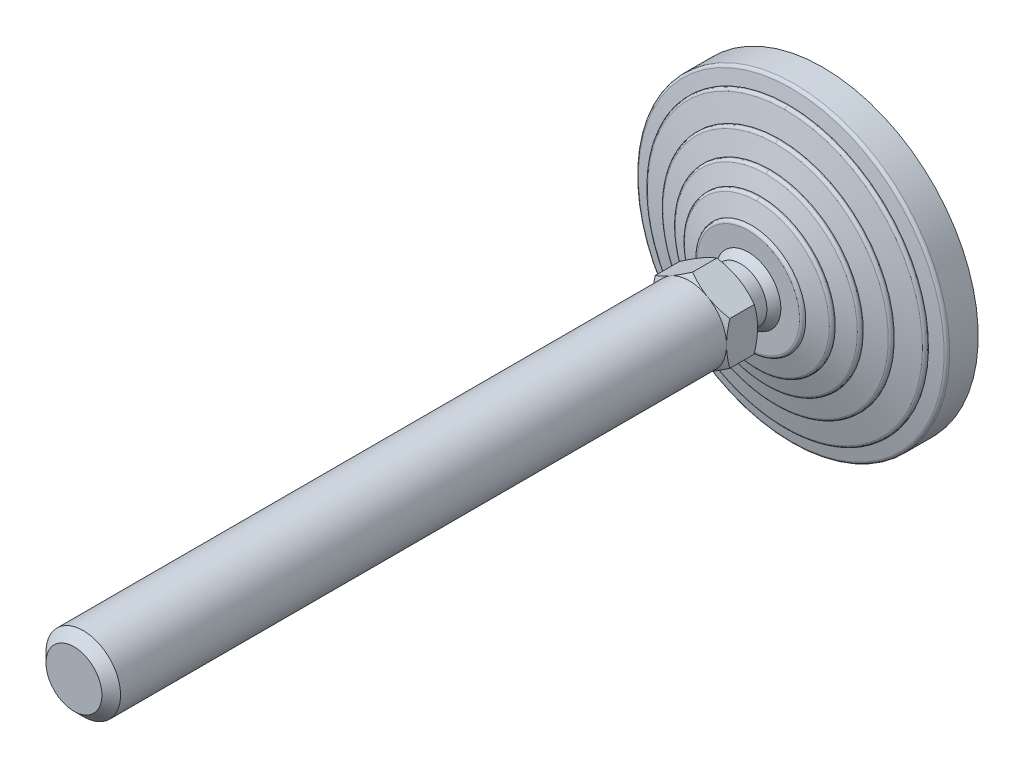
ISO-10303-21;
HEADER;
FILE_DESCRIPTION(('STEP AP214'),'2;1');
FILE_NAME('part.step','',(''),(''),'','','');
FILE_SCHEMA(('AUTOMOTIVE_DESIGN { 1 0 10303 214 1 1 1 1 }'));
ENDSEC;
DATA;
#1=APPLICATION_CONTEXT('core data for automotive mechanical design processes');
#2=APPLICATION_PROTOCOL_DEFINITION('international standard','automotive_design',2000,#1);
#3=PRODUCT_CONTEXT('',#1,'mechanical');
#4=PRODUCT('Part','Part','',(#3));
#5=PRODUCT_RELATED_PRODUCT_CATEGORY('part','',(#4));
#6=PRODUCT_DEFINITION_FORMATION('','',#4);
#7=PRODUCT_DEFINITION_CONTEXT('part definition',#1,'design');
#8=PRODUCT_DEFINITION('design','',#6,#7);
#9=PRODUCT_DEFINITION_SHAPE('','',#8);
#10=(LENGTH_UNIT() NAMED_UNIT(*) SI_UNIT(.MILLI.,.METRE.));
#11=(NAMED_UNIT(*) PLANE_ANGLE_UNIT() SI_UNIT($,.RADIAN.));
#12=(NAMED_UNIT(*) SI_UNIT($,.STERADIAN.) SOLID_ANGLE_UNIT());
#13=UNCERTAINTY_MEASURE_WITH_UNIT(LENGTH_MEASURE(1.E-05),#10,'distance_accuracy_value','');
#14=(GEOMETRIC_REPRESENTATION_CONTEXT(3) GLOBAL_UNCERTAINTY_ASSIGNED_CONTEXT((#13)) GLOBAL_UNIT_ASSIGNED_CONTEXT((#10,
#11,#12)) REPRESENTATION_CONTEXT('',''));
#15=CARTESIAN_POINT('',(0.,0.,0.));
#16=DIRECTION('',(0.,0.,1.));
#17=DIRECTION('',(1.,0.,0.));
#18=AXIS2_PLACEMENT_3D('',#15,#16,#17);
#19=CARTESIAN_POINT('',(-44.173478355,44.022,0.));
#20=DIRECTION('',(0.,0.,1.));
#21=DIRECTION('',(0.,-1.,0.));
#22=AXIS2_PLACEMENT_3D('',#19,#20,#21);
#23=PLANE('',#22);
#24=CARTESIAN_POINT('',(0.,0.,0.));
#25=DIRECTION('',(0.,0.,-1.));
#26=DIRECTION('',(0.,1.,0.));
#27=AXIS2_PLACEMENT_3D('',#24,#25,#26);
#28=CIRCLE('',#27,43.5);
#29=CARTESIAN_POINT('',(0.,43.5,0.));
#30=VERTEX_POINT('',#29);
#31=EDGE_CURVE('E449',#30,#30,#28,.F.);
#32=ORIENTED_EDGE('',*,*,#31,.F.);
#33=EDGE_LOOP('',(#32));
#34=FACE_BOUND('',#33,.T.);
#35=ADVANCED_FACE('F14',(#34),#23,.F.);
#36=CARTESIAN_POINT('',(0.,0.,3.));
#37=DIRECTION('',(0.,0.,-1.));
#38=DIRECTION('',(0.,1.,0.));
#39=AXIS2_PLACEMENT_3D('',#36,#37,#38);
#40=CYLINDRICAL_SURFACE('',#39,43.5);
#41=ORIENTED_EDGE('',*,*,#31,.T.);
#42=EDGE_LOOP('',(#41));
#43=FACE_BOUND('',#42,.T.);
#44=CARTESIAN_POINT('',(0.,0.,3.));
#45=DIRECTION('',(0.,0.,-1.));
#46=DIRECTION('',(0.,1.,0.));
#47=AXIS2_PLACEMENT_3D('',#44,#45,#46);
#48=CIRCLE('',#47,43.5);
#49=CARTESIAN_POINT('',(0.,43.5,3.));
#50=VERTEX_POINT('',#49);
#51=EDGE_CURVE('E452',#50,#50,#48,.T.);
#52=ORIENTED_EDGE('',*,*,#51,.T.);
#53=EDGE_LOOP('',(#52));
#54=FACE_BOUND('',#53,.T.);
#55=ADVANCED_FACE('F296',(#43,#54),#40,.T.);
#56=CARTESIAN_POINT('',(-50.774113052,50.6,3.));
#57=DIRECTION('',(0.,0.,1.));
#58=DIRECTION('',(0.,-1.,0.));
#59=AXIS2_PLACEMENT_3D('',#56,#57,#58);
#60=PLANE('',#59);
#61=ORIENTED_EDGE('',*,*,#51,.F.);
#62=EDGE_LOOP('',(#61));
#63=FACE_BOUND('',#62,.T.);
#64=CARTESIAN_POINT('',(0.,0.,3.));
#65=DIRECTION('',(0.,0.,-1.));
#66=DIRECTION('',(0.,1.,0.));
#67=AXIS2_PLACEMENT_3D('',#64,#65,#66);
#68=CIRCLE('',#67,50.);
#69=CARTESIAN_POINT('',(0.,50.,3.));
#70=VERTEX_POINT('',#69);
#71=EDGE_CURVE('E453',#70,#70,#68,.F.);
#72=ORIENTED_EDGE('',*,*,#71,.F.);
#73=EDGE_LOOP('',(#72));
#74=FACE_BOUND('',#73,.T.);
#75=ADVANCED_FACE('F293',(#63,#74),#60,.F.);
#76=CARTESIAN_POINT('',(0.,0.,12.180196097));
#77=DIRECTION('',(0.,0.,-1.));
#78=DIRECTION('',(0.,1.,0.));
#79=AXIS2_PLACEMENT_3D('',#76,#77,#78);
#80=CYLINDRICAL_SURFACE('',#79,50.);
#81=ORIENTED_EDGE('',*,*,#71,.T.);
#82=EDGE_LOOP('',(#81));
#83=FACE_BOUND('',#82,.T.);
#84=CARTESIAN_POINT('',(0.,0.,12.180196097));
#85=DIRECTION('',(0.,0.,1.));
#86=DIRECTION('',(0.,-1.,0.));
#87=AXIS2_PLACEMENT_3D('',#84,#85,#86);
#88=CIRCLE('',#87,50.);
#89=CARTESIAN_POINT('',(0.,-50.,12.180196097));
#90=VERTEX_POINT('',#89);
#91=EDGE_CURVE('E456',#90,#90,#88,.T.);
#92=ORIENTED_EDGE('',*,*,#91,.F.);
#93=EDGE_LOOP('',(#92));
#94=FACE_BOUND('',#93,.T.);
#95=ADVANCED_FACE('F291',(#83,#94),#80,.T.);
#96=CARTESIAN_POINT('',(0.,0.,12.180196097));
#97=DIRECTION('',(0.,0.,-1.));
#98=DIRECTION('',(0.,1.,0.));
#99=AXIS2_PLACEMENT_3D('',#96,#97,#98);
#100=TOROIDAL_SURFACE('',#99,48.9999999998,1.0000000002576);
#101=ORIENTED_EDGE('',*,*,#91,.T.);
#102=EDGE_LOOP('',(#101));
#103=FACE_BOUND('',#102,.T.);
#104=CARTESIAN_POINT('',(0.,0.,13.160776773));
#105=DIRECTION('',(0.,0.,-1.));
#106=DIRECTION('',(0.,1.,0.));
#107=AXIS2_PLACEMENT_3D('',#104,#105,#106);
#108=CIRCLE('',#107,49.196116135);
#109=CARTESIAN_POINT('',(0.,49.196116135,13.160776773));
#110=VERTEX_POINT('',#109);
#111=EDGE_CURVE('E665',#110,#110,#108,.F.);
#112=ORIENTED_EDGE('',*,*,#111,.F.);
#113=EDGE_LOOP('',(#112));
#114=FACE_BOUND('',#113,.T.);
#115=ADVANCED_FACE('F287',(#103,#114),#100,.T.);
#116=CARTESIAN_POINT('',(0.,0.,14.));
#117=DIRECTION('',(0.,0.,-1.));
#118=DIRECTION('',(1.,0.,0.));
#119=AXIS2_PLACEMENT_3D('',#116,#117,#118);
#120=CONICAL_SURFACE('',#119,45.,1.37340076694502);
#121=ORIENTED_EDGE('',*,*,#111,.T.);
#122=EDGE_LOOP('',(#121));
#123=FACE_BOUND('',#122,.T.);
#124=CARTESIAN_POINT('',(0.,0.,14.));
#125=DIRECTION('',(0.,0.,-1.));
#126=DIRECTION('',(0.,1.,0.));
#127=AXIS2_PLACEMENT_3D('',#124,#125,#126);
#128=CIRCLE('',#127,45.);
#129=CARTESIAN_POINT('',(0.,45.,14.));
#130=VERTEX_POINT('',#129);
#131=EDGE_CURVE('E656',#130,#130,#128,.F.);
#132=ORIENTED_EDGE('',*,*,#131,.F.);
#133=EDGE_LOOP('',(#132));
#134=FACE_BOUND('',#133,.T.);
#135=ADVANCED_FACE('F290',(#123,#134),#120,.T.);
#136=CARTESIAN_POINT('',(0.,0.,14.219223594));
#137=DIRECTION('',(0.,0.,-1.));
#138=DIRECTION('',(1.,0.,0.));
#139=AXIS2_PLACEMENT_3D('',#136,#137,#138);
#140=CYLINDRICAL_SURFACE('',#139,45.);
#141=ORIENTED_EDGE('',*,*,#131,.T.);
#142=EDGE_LOOP('',(#141));
#143=FACE_BOUND('',#142,.T.);
#144=CARTESIAN_POINT('',(0.,0.,14.219223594));
#145=DIRECTION('',(0.,0.,1.));
#146=DIRECTION('',(-1.,0.,0.));
#147=AXIS2_PLACEMENT_3D('',#144,#145,#146);
#148=CIRCLE('',#147,45.);
#149=CARTESIAN_POINT('',(-4.61482714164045E-09,-45.,14.219223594));
#150=VERTEX_POINT('',#149);
#151=CARTESIAN_POINT('',(0.,45.,14.219223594));
#152=VERTEX_POINT('',#151);
#153=EDGE_CURVE('E636',#150,#152,#148,.T.);
#154=ORIENTED_EDGE('',*,*,#153,.F.);
#155=CARTESIAN_POINT('',(0.,0.,14.219223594));
#156=DIRECTION('',(0.,0.,1.));
#157=DIRECTION('',(-1.,0.,0.));
#158=AXIS2_PLACEMENT_3D('',#155,#156,#157);
#159=CIRCLE('',#158,45.);
#160=EDGE_CURVE('E647',#152,#150,#159,.T.);
#161=ORIENTED_EDGE('',*,*,#160,.F.);
#162=EDGE_LOOP('',(#154,#161));
#163=FACE_BOUND('',#162,.T.);
#164=ADVANCED_FACE('F425',(#143,#163),#140,.T.);
#165=CARTESIAN_POINT('',(0.,-45.,14.219223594));
#166=CARTESIAN_POINT('',(-90.0000000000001,-45.,14.219223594));
#167=CARTESIAN_POINT('',(-90.0000000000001,45.,14.219223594));
#168=CARTESIAN_POINT('',(0.,45.,14.219223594));
#169=CARTESIAN_POINT('',(0.,-45.,14.696951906));
#170=CARTESIAN_POINT('',(-90.,-45.,14.696951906));
#171=CARTESIAN_POINT('',(-90.,45.,14.696951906));
#172=CARTESIAN_POINT('',(0.,45.,14.696951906));
#173=CARTESIAN_POINT('',(0.,-44.706000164,15.073499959));
#174=CARTESIAN_POINT('',(-89.4120003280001,-44.706000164,15.073499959));
#175=CARTESIAN_POINT('',(-89.4120003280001,44.706000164,15.073499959));
#176=CARTESIAN_POINT('',(0.,44.706000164,15.073499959));
#177=CARTESIAN_POINT('',(0.,-44.242535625,15.189366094));
#178=CARTESIAN_POINT('',(-88.4850712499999,-44.2425356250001,15.189366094));
#179=CARTESIAN_POINT('',(-88.4850712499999,44.2425356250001,15.189366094));
#180=CARTESIAN_POINT('',(0.,44.242535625,15.189366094));
#181=(BOUNDED_SURFACE() B_SPLINE_SURFACE(3,3,((#165,#166,#167,#168),(#169,#170,#171,#172),(#173,
#174,#175,#176),(#177,#178,#179,#180)),.UNSPECIFIED.,.F.,.F.,
.F.) B_SPLINE_SURFACE_WITH_KNOTS((4,4),(4,4),(0.,1.),(0.,1.),
.UNSPECIFIED.) GEOMETRIC_REPRESENTATION_ITEM() RATIONAL_B_SPLINE_SURFACE(((1.,0.333333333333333,
0.333333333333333,1.),(0.858803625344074,0.286267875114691,0.286267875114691,0.858803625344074),
(0.858803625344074,0.286267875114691,0.286267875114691,0.858803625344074),(1.,0.333333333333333,
0.333333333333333,1.))) REPRESENTATION_ITEM('') SURFACE());
#182=CARTESIAN_POINT('',(0.,45.,14.219223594));
#183=CARTESIAN_POINT('',(0.,45.,14.696951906));
#184=CARTESIAN_POINT('',(0.,44.706000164,15.073499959));
#185=CARTESIAN_POINT('',(0.,44.242535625,15.189366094));
#186=(BOUNDED_CURVE() B_SPLINE_CURVE(3,(#182,#183,#184,#185),.UNSPECIFIED.,.F.,
.F.) B_SPLINE_CURVE_WITH_KNOTS((4,4),(0.,1.),
.UNSPECIFIED.) CURVE() GEOMETRIC_REPRESENTATION_ITEM() RATIONAL_B_SPLINE_CURVE((1.,
0.858803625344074,0.858803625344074,1.)) REPRESENTATION_ITEM(''));
#187=CARTESIAN_POINT('',(0.,44.2425356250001,15.1893660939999));
#188=VERTEX_POINT('',#187);
#189=EDGE_CURVE('E627',#152,#188,#186,.T.);
#190=CARTESIAN_POINT('',(0.,-45.,14.219223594));
#191=CARTESIAN_POINT('',(0.,-45.,14.696951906));
#192=CARTESIAN_POINT('',(0.,-44.706000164,15.073499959));
#193=CARTESIAN_POINT('',(0.,-44.242535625,15.189366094));
#194=(BOUNDED_CURVE() B_SPLINE_CURVE(3,(#190,#191,#192,#193),.UNSPECIFIED.,.F.,
.F.) B_SPLINE_CURVE_WITH_KNOTS((4,4),(0.,1.),
.UNSPECIFIED.) CURVE() GEOMETRIC_REPRESENTATION_ITEM() RATIONAL_B_SPLINE_CURVE((1.,
0.858803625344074,0.858803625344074,1.)) REPRESENTATION_ITEM(''));
#195=CARTESIAN_POINT('',(-1.3611443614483E-08,-44.2425356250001,15.1893660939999));
#196=VERTEX_POINT('',#195);
#197=EDGE_CURVE('E641',#196,#150,#194,.F.);
#198=CARTESIAN_POINT('',(0.,0.,15.1893660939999));
#199=DIRECTION('',(0.,0.,-1.));
#200=DIRECTION('',(0.,1.,0.));
#201=AXIS2_PLACEMENT_3D('',#198,#199,#200);
#202=CIRCLE('',#201,44.242535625);
#203=EDGE_CURVE('E624',#188,#196,#202,.F.);
#204=ORIENTED_EDGE('',*,*,#189,.F.);
#205=ORIENTED_EDGE('',*,*,#160,.T.);
#206=ORIENTED_EDGE('',*,*,#197,.F.);
#207=ORIENTED_EDGE('',*,*,#203,.F.);
#208=EDGE_LOOP('',(#204,#205,#206,#207));
#209=FACE_BOUND('',#208,.T.);
#210=ADVANCED_FACE('F414',(#209),#181,.T.);
#211=CARTESIAN_POINT('',(0.,45.,14.219223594));
#212=CARTESIAN_POINT('',(90.0000000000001,45.,14.219223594));
#213=CARTESIAN_POINT('',(90.0000000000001,-45.,14.219223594));
#214=CARTESIAN_POINT('',(0.,-45.,14.219223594));
#215=CARTESIAN_POINT('',(0.,45.,14.696951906));
#216=CARTESIAN_POINT('',(90.,45.,14.696951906));
#217=CARTESIAN_POINT('',(90.,-45.,14.696951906));
#218=CARTESIAN_POINT('',(0.,-45.,14.696951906));
#219=CARTESIAN_POINT('',(0.,44.706000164,15.073499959));
#220=CARTESIAN_POINT('',(89.4120003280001,44.706000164,15.073499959));
#221=CARTESIAN_POINT('',(89.4120003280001,-44.706000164,15.073499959));
#222=CARTESIAN_POINT('',(0.,-44.706000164,15.073499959));
#223=CARTESIAN_POINT('',(0.,44.242535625,15.189366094));
#224=CARTESIAN_POINT('',(88.4850712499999,44.2425356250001,15.189366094));
#225=CARTESIAN_POINT('',(88.4850712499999,-44.2425356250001,15.189366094));
#226=CARTESIAN_POINT('',(0.,-44.242535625,15.189366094));
#227=(BOUNDED_SURFACE() B_SPLINE_SURFACE(3,3,((#211,#212,#213,#214),(#215,#216,#217,#218),(#219,
#220,#221,#222),(#223,#224,#225,#226)),.UNSPECIFIED.,.F.,.F.,
.F.) B_SPLINE_SURFACE_WITH_KNOTS((4,4),(4,4),(0.,1.),(0.,1.),
.UNSPECIFIED.) GEOMETRIC_REPRESENTATION_ITEM() RATIONAL_B_SPLINE_SURFACE(((1.,0.333333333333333,
0.333333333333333,1.),(0.858803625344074,0.286267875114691,0.286267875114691,0.858803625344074),
(0.858803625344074,0.286267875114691,0.286267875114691,0.858803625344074),(1.,0.333333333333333,
0.333333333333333,1.))) REPRESENTATION_ITEM('') SURFACE());
#228=CARTESIAN_POINT('',(0.,0.,15.1893660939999));
#229=DIRECTION('',(0.,0.,-1.));
#230=DIRECTION('',(0.,1.,0.));
#231=AXIS2_PLACEMENT_3D('',#228,#229,#230);
#232=CIRCLE('',#231,44.242535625);
#233=EDGE_CURVE('E623',#196,#188,#232,.F.);
#234=ORIENTED_EDGE('',*,*,#153,.T.);
#235=ORIENTED_EDGE('',*,*,#189,.T.);
#236=ORIENTED_EDGE('',*,*,#233,.F.);
#237=ORIENTED_EDGE('',*,*,#197,.T.);
#238=EDGE_LOOP('',(#234,#235,#236,#237));
#239=FACE_BOUND('',#238,.T.);
#240=ADVANCED_FACE('F408',(#239),#227,.T.);
#241=CARTESIAN_POINT('',(0.,0.,17.));
#242=DIRECTION('',(0.,0.,-1.));
#243=DIRECTION('',(0.,1.,0.));
#244=AXIS2_PLACEMENT_3D('',#241,#242,#243);
#245=CONICAL_SURFACE('',#244,37.,1.32581766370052);
#246=ORIENTED_EDGE('',*,*,#203,.T.);
#247=ORIENTED_EDGE('',*,*,#233,.T.);
#248=EDGE_LOOP('',(#246,#247));
#249=FACE_BOUND('',#248,.T.);
#250=CARTESIAN_POINT('',(0.,0.,17.));
#251=DIRECTION('',(0.,0.,-1.));
#252=DIRECTION('',(0.,1.,0.));
#253=AXIS2_PLACEMENT_3D('',#250,#251,#252);
#254=CIRCLE('',#253,37.);
#255=CARTESIAN_POINT('',(0.,37.,17.));
#256=VERTEX_POINT('',#255);
#257=EDGE_CURVE('E614',#256,#256,#254,.F.);
#258=ORIENTED_EDGE('',*,*,#257,.F.);
#259=EDGE_LOOP('',(#258));
#260=FACE_BOUND('',#259,.T.);
#261=ADVANCED_FACE('F404',(#249,#260),#245,.T.);
#262=CARTESIAN_POINT('',(0.,0.,17.245698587));
#263=DIRECTION('',(0.,0.,-1.));
#264=DIRECTION('',(1.,0.,0.));
#265=AXIS2_PLACEMENT_3D('',#262,#263,#264);
#266=CYLINDRICAL_SURFACE('',#265,37.);
#267=ORIENTED_EDGE('',*,*,#257,.T.);
#268=EDGE_LOOP('',(#267));
#269=FACE_BOUND('',#268,.T.);
#270=CARTESIAN_POINT('',(0.,0.,17.245698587));
#271=DIRECTION('',(0.,0.,1.));
#272=DIRECTION('',(0.,-1.,0.));
#273=AXIS2_PLACEMENT_3D('',#270,#271,#272);
#274=CIRCLE('',#273,37.);
#275=CARTESIAN_POINT('',(-3.79441342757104E-09,-37.,17.245698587));
#276=VERTEX_POINT('',#275);
#277=CARTESIAN_POINT('',(0.,37.,17.245698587));
#278=VERTEX_POINT('',#277);
#279=EDGE_CURVE('E594',#276,#278,#274,.T.);
#280=ORIENTED_EDGE('',*,*,#279,.F.);
#281=CARTESIAN_POINT('',(0.,0.,17.245698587));
#282=DIRECTION('',(0.,0.,1.));
#283=DIRECTION('',(0.,-1.,0.));
#284=AXIS2_PLACEMENT_3D('',#281,#282,#283);
#285=CIRCLE('',#284,37.);
#286=EDGE_CURVE('E605',#278,#276,#285,.T.);
#287=ORIENTED_EDGE('',*,*,#286,.F.);
#288=EDGE_LOOP('',(#280,#287));
#289=FACE_BOUND('',#288,.T.);
#290=ADVANCED_FACE('F395',(#269,#289),#266,.T.);
#291=CARTESIAN_POINT('',(0.,-37.,17.245698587));
#292=CARTESIAN_POINT('',(-74.,-37.,17.245698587));
#293=CARTESIAN_POINT('',(-74.,37.,17.245698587));
#294=CARTESIAN_POINT('',(0.,37.,17.245698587));
#295=CARTESIAN_POINT('',(0.,-37.,17.709515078));
#296=CARTESIAN_POINT('',(-74.,-37.,17.709515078));
#297=CARTESIAN_POINT('',(-74.,37.,17.709515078));
#298=CARTESIAN_POINT('',(0.,37.,17.709515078));
#299=CARTESIAN_POINT('',(0.,-36.720691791,18.079802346));
#300=CARTESIAN_POINT('',(-73.441383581,-36.720691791,18.079802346));
#301=CARTESIAN_POINT('',(-73.441383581,36.720691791,18.079802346));
#302=CARTESIAN_POINT('',(0.,36.720691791,18.079802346));
#303=CARTESIAN_POINT('',(0.,-36.274721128,18.207222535));
#304=CARTESIAN_POINT('',(-72.549442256,-36.274721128,18.207222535));
#305=CARTESIAN_POINT('',(-72.549442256,36.274721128,18.207222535));
#306=CARTESIAN_POINT('',(0.,36.274721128,18.207222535));
#307=(BOUNDED_SURFACE() B_SPLINE_SURFACE(3,3,((#291,#292,#293,#294),(#295,#296,#297,#298),(#299,
#300,#301,#302),(#303,#304,#305,#306)),.UNSPECIFIED.,.F.,.F.,
.F.) B_SPLINE_SURFACE_WITH_KNOTS((4,4),(4,4),(0.,1.),(0.,1.),
.UNSPECIFIED.) GEOMETRIC_REPRESENTATION_ITEM() RATIONAL_B_SPLINE_SURFACE(((1.,0.333333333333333,
0.333333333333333,1.),(0.865565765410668,0.288521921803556,0.288521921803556,0.865565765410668),
(0.865565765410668,0.288521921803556,0.288521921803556,0.865565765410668),(1.,0.333333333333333,
0.333333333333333,1.))) REPRESENTATION_ITEM('') SURFACE());
#308=CARTESIAN_POINT('',(0.,37.,17.245698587));
#309=CARTESIAN_POINT('',(0.,37.,17.709515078));
#310=CARTESIAN_POINT('',(0.,36.720691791,18.079802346));
#311=CARTESIAN_POINT('',(0.,36.274721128,18.207222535));
#312=(BOUNDED_CURVE() B_SPLINE_CURVE(3,(#308,#309,#310,#311),.UNSPECIFIED.,.F.,
.F.) B_SPLINE_CURVE_WITH_KNOTS((4,4),(0.,1.),
.UNSPECIFIED.) CURVE() GEOMETRIC_REPRESENTATION_ITEM() RATIONAL_B_SPLINE_CURVE((1.,
0.865565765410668,0.865565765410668,1.)) REPRESENTATION_ITEM(''));
#313=CARTESIAN_POINT('',(0.,36.2747211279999,18.207222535));
#314=VERTEX_POINT('',#313);
#315=EDGE_CURVE('E585',#278,#314,#312,.T.);
#316=CARTESIAN_POINT('',(0.,-37.,17.245698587));
#317=CARTESIAN_POINT('',(0.,-37.,17.709515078));
#318=CARTESIAN_POINT('',(0.,-36.720691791,18.079802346));
#319=CARTESIAN_POINT('',(0.,-36.274721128,18.207222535));
#320=(BOUNDED_CURVE() B_SPLINE_CURVE(3,(#316,#317,#318,#319),.UNSPECIFIED.,.F.,
.F.) B_SPLINE_CURVE_WITH_KNOTS((4,4),(0.,1.),
.UNSPECIFIED.) CURVE() GEOMETRIC_REPRESENTATION_ITEM() RATIONAL_B_SPLINE_CURVE((1.,
0.865565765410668,0.865565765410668,1.)) REPRESENTATION_ITEM(''));
#321=CARTESIAN_POINT('',(-1.11601045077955E-08,-36.2747211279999,18.207222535));
#322=VERTEX_POINT('',#321);
#323=EDGE_CURVE('E599',#322,#276,#320,.F.);
#324=CARTESIAN_POINT('',(0.,0.,18.207222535));
#325=DIRECTION('',(0.,0.,-1.));
#326=DIRECTION('',(0.,1.,0.));
#327=AXIS2_PLACEMENT_3D('',#324,#325,#326);
#328=CIRCLE('',#327,36.274721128);
#329=EDGE_CURVE('E582',#314,#322,#328,.F.);
#330=ORIENTED_EDGE('',*,*,#315,.F.);
#331=ORIENTED_EDGE('',*,*,#286,.T.);
#332=ORIENTED_EDGE('',*,*,#323,.F.);
#333=ORIENTED_EDGE('',*,*,#329,.F.);
#334=EDGE_LOOP('',(#330,#331,#332,#333));
#335=FACE_BOUND('',#334,.T.);
#336=ADVANCED_FACE('F384',(#335),#307,.T.);
#337=CARTESIAN_POINT('',(0.,37.,17.245698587));
#338=CARTESIAN_POINT('',(74.,37.,17.245698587));
#339=CARTESIAN_POINT('',(74.,-37.,17.245698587));
#340=CARTESIAN_POINT('',(0.,-37.,17.245698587));
#341=CARTESIAN_POINT('',(0.,37.,17.709515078));
#342=CARTESIAN_POINT('',(74.,37.,17.709515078));
#343=CARTESIAN_POINT('',(74.,-37.,17.709515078));
#344=CARTESIAN_POINT('',(0.,-37.,17.709515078));
#345=CARTESIAN_POINT('',(0.,36.720691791,18.079802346));
#346=CARTESIAN_POINT('',(73.441383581,36.720691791,18.079802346));
#347=CARTESIAN_POINT('',(73.441383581,-36.720691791,18.079802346));
#348=CARTESIAN_POINT('',(0.,-36.720691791,18.079802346));
#349=CARTESIAN_POINT('',(0.,36.274721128,18.207222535));
#350=CARTESIAN_POINT('',(72.549442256,36.274721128,18.207222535));
#351=CARTESIAN_POINT('',(72.549442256,-36.274721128,18.207222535));
#352=CARTESIAN_POINT('',(0.,-36.274721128,18.207222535));
#353=(BOUNDED_SURFACE() B_SPLINE_SURFACE(3,3,((#337,#338,#339,#340),(#341,#342,#343,#344),(#345,
#346,#347,#348),(#349,#350,#351,#352)),.UNSPECIFIED.,.F.,.F.,
.F.) B_SPLINE_SURFACE_WITH_KNOTS((4,4),(4,4),(0.,1.),(0.,1.),
.UNSPECIFIED.) GEOMETRIC_REPRESENTATION_ITEM() RATIONAL_B_SPLINE_SURFACE(((1.,0.333333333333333,
0.333333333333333,1.),(0.865565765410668,0.288521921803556,0.288521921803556,0.865565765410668),
(0.865565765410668,0.288521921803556,0.288521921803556,0.865565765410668),(1.,0.333333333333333,
0.333333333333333,1.))) REPRESENTATION_ITEM('') SURFACE());
#354=CARTESIAN_POINT('',(0.,0.,18.207222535));
#355=DIRECTION('',(0.,0.,-1.));
#356=DIRECTION('',(0.,1.,0.));
#357=AXIS2_PLACEMENT_3D('',#354,#355,#356);
#358=CIRCLE('',#357,36.274721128);
#359=EDGE_CURVE('E581',#322,#314,#358,.F.);
#360=ORIENTED_EDGE('',*,*,#279,.T.);
#361=ORIENTED_EDGE('',*,*,#315,.T.);
#362=ORIENTED_EDGE('',*,*,#359,.F.);
#363=ORIENTED_EDGE('',*,*,#323,.T.);
#364=EDGE_LOOP('',(#360,#361,#362,#363));
#365=FACE_BOUND('',#364,.T.);
#366=ADVANCED_FACE('F378',(#365),#353,.T.);
#367=CARTESIAN_POINT('',(0.,0.,20.));
#368=DIRECTION('',(0.,0.,-1.));
#369=DIRECTION('',(1.,0.,0.));
#370=AXIS2_PLACEMENT_3D('',#367,#368,#369);
#371=CONICAL_SURFACE('',#370,30.,1.29249666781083);
#372=ORIENTED_EDGE('',*,*,#329,.T.);
#373=ORIENTED_EDGE('',*,*,#359,.T.);
#374=EDGE_LOOP('',(#372,#373));
#375=FACE_BOUND('',#374,.T.);
#376=CARTESIAN_POINT('',(0.,0.,20.));
#377=DIRECTION('',(0.,0.,-1.));
#378=DIRECTION('',(0.,1.,0.));
#379=AXIS2_PLACEMENT_3D('',#376,#377,#378);
#380=CIRCLE('',#379,30.);
#381=CARTESIAN_POINT('',(0.,30.,20.));
#382=VERTEX_POINT('',#381);
#383=EDGE_CURVE('E572',#382,#382,#380,.F.);
#384=ORIENTED_EDGE('',*,*,#383,.F.);
#385=EDGE_LOOP('',(#384));
#386=FACE_BOUND('',#385,.T.);
#387=ADVANCED_FACE('F374',(#375,#386),#371,.T.);
#388=CARTESIAN_POINT('',(0.,0.,20.27924078));
#389=DIRECTION('',(0.,0.,-1.));
#390=DIRECTION('',(0.,1.,0.));
#391=AXIS2_PLACEMENT_3D('',#388,#389,#390);
#392=CYLINDRICAL_SURFACE('',#391,30.);
#393=ORIENTED_EDGE('',*,*,#383,.T.);
#394=EDGE_LOOP('',(#393));
#395=FACE_BOUND('',#394,.T.);
#396=CARTESIAN_POINT('',(0.,0.,20.27924078));
#397=DIRECTION('',(0.,0.,1.));
#398=DIRECTION('',(0.,-1.,0.));
#399=AXIS2_PLACEMENT_3D('',#396,#397,#398);
#400=CIRCLE('',#399,30.);
#401=CARTESIAN_POINT('',(-3.0765514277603E-09,-30.,20.27924078));
#402=VERTEX_POINT('',#401);
#403=CARTESIAN_POINT('',(0.,30.,20.27924078));
#404=VERTEX_POINT('',#403);
#405=EDGE_CURVE('E552',#402,#404,#400,.T.);
#406=ORIENTED_EDGE('',*,*,#405,.F.);
#407=CARTESIAN_POINT('',(0.,0.,20.27924078));
#408=DIRECTION('',(0.,0.,1.));
#409=DIRECTION('',(0.,-1.,0.));
#410=AXIS2_PLACEMENT_3D('',#407,#408,#409);
#411=CIRCLE('',#410,30.);
#412=EDGE_CURVE('E563',#404,#402,#411,.T.);
#413=ORIENTED_EDGE('',*,*,#412,.F.);
#414=EDGE_LOOP('',(#406,#413));
#415=FACE_BOUND('',#414,.T.);
#416=ADVANCED_FACE('F365',(#395,#415),#392,.T.);
#417=CARTESIAN_POINT('',(0.,-30.,20.27924078));
#418=CARTESIAN_POINT('',(-60.0000000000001,-30.,20.27924078));
#419=CARTESIAN_POINT('',(-60.0000000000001,30.,20.27924078));
#420=CARTESIAN_POINT('',(0.,30.,20.27924078));
#421=CARTESIAN_POINT('',(0.,-30.,20.725161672));
#422=CARTESIAN_POINT('',(-59.9999999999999,-30.,20.725161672));
#423=CARTESIAN_POINT('',(-59.9999999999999,30.,20.725161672));
#424=CARTESIAN_POINT('',(0.,30.,20.725161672));
#425=CARTESIAN_POINT('',(0.,-29.739265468,21.086911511));
#426=CARTESIAN_POINT('',(-59.478530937,-29.739265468,21.086911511));
#427=CARTESIAN_POINT('',(-59.478530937,29.739265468,21.086911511));
#428=CARTESIAN_POINT('',(0.,29.739265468,21.086911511));
#429=CARTESIAN_POINT('',(0.,-29.316227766,21.227924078));
#430=CARTESIAN_POINT('',(-58.6324555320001,-29.316227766,21.227924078));
#431=CARTESIAN_POINT('',(-58.6324555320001,29.316227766,21.227924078));
#432=CARTESIAN_POINT('',(0.,29.316227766,21.227924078));
#433=(BOUNDED_SURFACE() B_SPLINE_SURFACE(3,3,((#417,#418,#419,#420),(#421,#422,#423,#424),(#425,
#426,#427,#428),(#429,#430,#431,#432)),.UNSPECIFIED.,.F.,.F.,
.F.) B_SPLINE_SURFACE_WITH_KNOTS((4,4),(4,4),(0.,1.),(0.,1.),
.UNSPECIFIED.) GEOMETRIC_REPRESENTATION_ITEM() RATIONAL_B_SPLINE_SURFACE(((1.,0.333333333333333,
0.333333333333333,1.),(0.874161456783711,0.291387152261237,0.291387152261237,0.874161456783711),
(0.874161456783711,0.291387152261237,0.291387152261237,0.874161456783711),(1.,0.333333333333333,
0.333333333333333,1.))) REPRESENTATION_ITEM('') SURFACE());
#434=CARTESIAN_POINT('',(0.,30.,20.27924078));
#435=CARTESIAN_POINT('',(0.,30.,20.725161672));
#436=CARTESIAN_POINT('',(0.,29.739265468,21.086911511));
#437=CARTESIAN_POINT('',(0.,29.316227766,21.227924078));
#438=(BOUNDED_CURVE() B_SPLINE_CURVE(3,(#434,#435,#436,#437),.UNSPECIFIED.,.F.,
.F.) B_SPLINE_CURVE_WITH_KNOTS((4,4),(0.,1.),
.UNSPECIFIED.) CURVE() GEOMETRIC_REPRESENTATION_ITEM() RATIONAL_B_SPLINE_CURVE((1.,
0.874161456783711,0.874161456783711,1.)) REPRESENTATION_ITEM(''));
#439=CARTESIAN_POINT('',(0.,29.316227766,21.227924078));
#440=VERTEX_POINT('',#439);
#441=EDGE_CURVE('E543',#404,#440,#438,.T.);
#442=CARTESIAN_POINT('',(0.,-30.,20.27924078));
#443=CARTESIAN_POINT('',(0.,-30.,20.725161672));
#444=CARTESIAN_POINT('',(0.,-29.739265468,21.086911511));
#445=CARTESIAN_POINT('',(0.,-29.316227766,21.227924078));
#446=(BOUNDED_CURVE() B_SPLINE_CURVE(3,(#442,#443,#444,#445),.UNSPECIFIED.,.F.,
.F.) B_SPLINE_CURVE_WITH_KNOTS((4,4),(0.,1.),
.UNSPECIFIED.) CURVE() GEOMETRIC_REPRESENTATION_ITEM() RATIONAL_B_SPLINE_CURVE((1.,
0.874161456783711,0.874161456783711,1.)) REPRESENTATION_ITEM(''));
#447=CARTESIAN_POINT('',(-9.01928823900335E-09,-29.316227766,21.227924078));
#448=VERTEX_POINT('',#447);
#449=EDGE_CURVE('E557',#448,#402,#446,.F.);
#450=CARTESIAN_POINT('',(0.,0.,21.227924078));
#451=DIRECTION('',(0.,0.,-1.));
#452=DIRECTION('',(0.,1.,0.));
#453=AXIS2_PLACEMENT_3D('',#450,#451,#452);
#454=CIRCLE('',#453,29.316227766);
#455=EDGE_CURVE('E540',#440,#448,#454,.F.);
#456=ORIENTED_EDGE('',*,*,#441,.F.);
#457=ORIENTED_EDGE('',*,*,#412,.T.);
#458=ORIENTED_EDGE('',*,*,#449,.F.);
#459=ORIENTED_EDGE('',*,*,#455,.F.);
#460=EDGE_LOOP('',(#456,#457,#458,#459));
#461=FACE_BOUND('',#460,.T.);
#462=ADVANCED_FACE('F354',(#461),#433,.T.);
#463=CARTESIAN_POINT('',(0.,30.,20.27924078));
#464=CARTESIAN_POINT('',(60.0000000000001,30.,20.27924078));
#465=CARTESIAN_POINT('',(60.0000000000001,-30.,20.27924078));
#466=CARTESIAN_POINT('',(0.,-30.,20.27924078));
#467=CARTESIAN_POINT('',(0.,30.,20.725161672));
#468=CARTESIAN_POINT('',(59.9999999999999,30.,20.725161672));
#469=CARTESIAN_POINT('',(59.9999999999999,-30.,20.725161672));
#470=CARTESIAN_POINT('',(0.,-30.,20.725161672));
#471=CARTESIAN_POINT('',(0.,29.739265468,21.086911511));
#472=CARTESIAN_POINT('',(59.478530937,29.739265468,21.086911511));
#473=CARTESIAN_POINT('',(59.478530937,-29.739265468,21.086911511));
#474=CARTESIAN_POINT('',(0.,-29.739265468,21.086911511));
#475=CARTESIAN_POINT('',(0.,29.316227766,21.227924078));
#476=CARTESIAN_POINT('',(58.6324555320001,29.316227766,21.227924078));
#477=CARTESIAN_POINT('',(58.6324555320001,-29.316227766,21.227924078));
#478=CARTESIAN_POINT('',(0.,-29.316227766,21.227924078));
#479=(BOUNDED_SURFACE() B_SPLINE_SURFACE(3,3,((#463,#464,#465,#466),(#467,#468,#469,#470),(#471,
#472,#473,#474),(#475,#476,#477,#478)),.UNSPECIFIED.,.F.,.F.,
.F.) B_SPLINE_SURFACE_WITH_KNOTS((4,4),(4,4),(0.,1.),(0.,1.),
.UNSPECIFIED.) GEOMETRIC_REPRESENTATION_ITEM() RATIONAL_B_SPLINE_SURFACE(((1.,0.333333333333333,
0.333333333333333,1.),(0.874161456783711,0.291387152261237,0.291387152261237,0.874161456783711),
(0.874161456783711,0.291387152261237,0.291387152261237,0.874161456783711),(1.,0.333333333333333,
0.333333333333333,1.))) REPRESENTATION_ITEM('') SURFACE());
#480=CARTESIAN_POINT('',(0.,0.,21.227924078));
#481=DIRECTION('',(0.,0.,-1.));
#482=DIRECTION('',(0.,1.,0.));
#483=AXIS2_PLACEMENT_3D('',#480,#481,#482);
#484=CIRCLE('',#483,29.316227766);
#485=EDGE_CURVE('E539',#448,#440,#484,.F.);
#486=ORIENTED_EDGE('',*,*,#405,.T.);
#487=ORIENTED_EDGE('',*,*,#441,.T.);
#488=ORIENTED_EDGE('',*,*,#485,.F.);
#489=ORIENTED_EDGE('',*,*,#449,.T.);
#490=EDGE_LOOP('',(#486,#487,#488,#489));
#491=FACE_BOUND('',#490,.T.);
#492=ADVANCED_FACE('F348',(#491),#479,.T.);
#493=CARTESIAN_POINT('',(0.,0.,23.));
#494=DIRECTION('',(0.,0.,-1.));
#495=DIRECTION('',(0.,1.,0.));
#496=AXIS2_PLACEMENT_3D('',#493,#494,#495);
#497=CONICAL_SURFACE('',#496,24.,1.24904577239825);
#498=ORIENTED_EDGE('',*,*,#455,.T.);
#499=ORIENTED_EDGE('',*,*,#485,.T.);
#500=EDGE_LOOP('',(#498,#499));
#501=FACE_BOUND('',#500,.T.);
#502=CARTESIAN_POINT('',(0.,0.,23.));
#503=DIRECTION('',(0.,0.,-1.));
#504=DIRECTION('',(0.,1.,0.));
#505=AXIS2_PLACEMENT_3D('',#502,#503,#504);
#506=CIRCLE('',#505,24.);
#507=CARTESIAN_POINT('',(0.,24.,23.));
#508=VERTEX_POINT('',#507);
#509=EDGE_CURVE('E530',#508,#508,#506,.F.);
#510=ORIENTED_EDGE('',*,*,#509,.F.);
#511=EDGE_LOOP('',(#510));
#512=FACE_BOUND('',#511,.T.);
#513=ADVANCED_FACE('F344',(#501,#512),#497,.T.);
#514=CARTESIAN_POINT('',(0.,0.,23.261425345));
#515=DIRECTION('',(0.,0.,-1.));
#516=DIRECTION('',(0.,1.,0.));
#517=AXIS2_PLACEMENT_3D('',#514,#515,#516);
#518=CYLINDRICAL_SURFACE('',#517,24.);
#519=ORIENTED_EDGE('',*,*,#509,.T.);
#520=EDGE_LOOP('',(#519));
#521=FACE_BOUND('',#520,.T.);
#522=CARTESIAN_POINT('',(0.,0.,23.261425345));
#523=DIRECTION('',(0.,0.,1.));
#524=DIRECTION('',(0.,-1.,0.));
#525=AXIS2_PLACEMENT_3D('',#522,#523,#524);
#526=CIRCLE('',#525,24.);
#527=CARTESIAN_POINT('',(-2.46124114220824E-09,-24.,23.261425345));
#528=VERTEX_POINT('',#527);
#529=CARTESIAN_POINT('',(0.,24.,23.261425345));
#530=VERTEX_POINT('',#529);
#531=EDGE_CURVE('E510',#528,#530,#526,.T.);
#532=ORIENTED_EDGE('',*,*,#531,.F.);
#533=CARTESIAN_POINT('',(0.,0.,23.261425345));
#534=DIRECTION('',(0.,0.,1.));
#535=DIRECTION('',(0.,-1.,0.));
#536=AXIS2_PLACEMENT_3D('',#533,#534,#535);
#537=CIRCLE('',#536,24.);
#538=EDGE_CURVE('E521',#530,#528,#537,.T.);
#539=ORIENTED_EDGE('',*,*,#538,.F.);
#540=EDGE_LOOP('',(#532,#539));
#541=FACE_BOUND('',#540,.T.);
#542=ADVANCED_FACE('F335',(#521,#541),#518,.T.);
#543=CARTESIAN_POINT('',(0.,-24.,23.261425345));
#544=CARTESIAN_POINT('',(-48.,-24.,23.261425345));
#545=CARTESIAN_POINT('',(-48.,24.,23.261425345));
#546=CARTESIAN_POINT('',(0.,24.,23.261425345));
#547=CARTESIAN_POINT('',(0.,-24.,23.716888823));
#548=CARTESIAN_POINT('',(-48.,-24.,23.716888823));
#549=CARTESIAN_POINT('',(-48.,24.,23.716888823));
#550=CARTESIAN_POINT('',(0.,24.,23.716888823));
#551=CARTESIAN_POINT('',(0.,-23.72940828,24.083258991));
#552=CARTESIAN_POINT('',(-47.458816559,-23.72940828,24.083258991));
#553=CARTESIAN_POINT('',(-47.458816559,23.72940828,24.083258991));
#554=CARTESIAN_POINT('',(0.,23.72940828,24.083258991));
#555=CARTESIAN_POINT('',(0.,-23.294085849,24.217204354));
#556=CARTESIAN_POINT('',(-46.5881716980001,-23.294085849,24.217204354));
#557=CARTESIAN_POINT('',(-46.5881716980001,23.294085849,24.217204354));
#558=CARTESIAN_POINT('',(0.,23.294085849,24.217204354));
#559=(BOUNDED_SURFACE() B_SPLINE_SURFACE(3,3,((#543,#544,#545,#546),(#547,#548,#549,#550),(#551,
#552,#553,#554),(#555,#556,#557,#558)),.UNSPECIFIED.,.F.,.F.,
.F.) B_SPLINE_SURFACE_WITH_KNOTS((4,4),(4,4),(0.,1.),(0.,1.),
.UNSPECIFIED.) GEOMETRIC_REPRESENTATION_ITEM() RATIONAL_B_SPLINE_SURFACE(((1.,0.333333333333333,
0.333333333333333,1.),(0.869593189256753,0.289864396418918,0.289864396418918,0.869593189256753),
(0.869593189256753,0.289864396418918,0.289864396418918,0.869593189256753),(1.,0.333333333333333,
0.333333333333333,1.))) REPRESENTATION_ITEM('') SURFACE());
#560=CARTESIAN_POINT('',(0.,24.,23.261425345));
#561=CARTESIAN_POINT('',(0.,24.,23.716888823));
#562=CARTESIAN_POINT('',(0.,23.72940828,24.083258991));
#563=CARTESIAN_POINT('',(0.,23.294085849,24.217204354));
#564=(BOUNDED_CURVE() B_SPLINE_CURVE(3,(#560,#561,#562,#563),.UNSPECIFIED.,.F.,
.F.) B_SPLINE_CURVE_WITH_KNOTS((4,4),(0.,1.),
.UNSPECIFIED.) CURVE() GEOMETRIC_REPRESENTATION_ITEM() RATIONAL_B_SPLINE_CURVE((1.,
0.869593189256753,0.869593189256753,1.)) REPRESENTATION_ITEM(''));
#565=CARTESIAN_POINT('',(0.,23.2940858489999,24.2172043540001));
#566=VERTEX_POINT('',#565);
#567=EDGE_CURVE('E501',#530,#566,#564,.T.);
#568=CARTESIAN_POINT('',(0.,-24.,23.261425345));
#569=CARTESIAN_POINT('',(0.,-24.,23.716888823));
#570=CARTESIAN_POINT('',(0.,-23.72940828,24.083258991));
#571=CARTESIAN_POINT('',(0.,-23.294085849,24.217204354));
#572=(BOUNDED_CURVE() B_SPLINE_CURVE(3,(#568,#569,#570,#571),.UNSPECIFIED.,.F.,
.F.) B_SPLINE_CURVE_WITH_KNOTS((4,4),(0.,1.),
.UNSPECIFIED.) CURVE() GEOMETRIC_REPRESENTATION_ITEM() RATIONAL_B_SPLINE_CURVE((1.,
0.869593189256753,0.869593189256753,1.)) REPRESENTATION_ITEM(''));
#573=CARTESIAN_POINT('',(-7.16654530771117E-09,-23.2940858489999,24.2172043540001));
#574=VERTEX_POINT('',#573);
#575=EDGE_CURVE('E515',#574,#528,#572,.F.);
#576=CARTESIAN_POINT('',(0.,0.,24.2172043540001));
#577=DIRECTION('',(0.,0.,-1.));
#578=DIRECTION('',(0.,1.,0.));
#579=AXIS2_PLACEMENT_3D('',#576,#577,#578);
#580=CIRCLE('',#579,23.294085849);
#581=EDGE_CURVE('E498',#566,#574,#580,.F.);
#582=ORIENTED_EDGE('',*,*,#567,.F.);
#583=ORIENTED_EDGE('',*,*,#538,.T.);
#584=ORIENTED_EDGE('',*,*,#575,.F.);
#585=ORIENTED_EDGE('',*,*,#581,.F.);
#586=EDGE_LOOP('',(#582,#583,#584,#585));
#587=FACE_BOUND('',#586,.T.);
#588=ADVANCED_FACE('F324',(#587),#559,.T.);
#589=CARTESIAN_POINT('',(0.,24.,23.261425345));
#590=CARTESIAN_POINT('',(48.,24.,23.261425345));
#591=CARTESIAN_POINT('',(48.,-24.,23.261425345));
#592=CARTESIAN_POINT('',(0.,-24.,23.261425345));
#593=CARTESIAN_POINT('',(0.,24.,23.716888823));
#594=CARTESIAN_POINT('',(48.,24.,23.716888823));
#595=CARTESIAN_POINT('',(48.,-24.,23.716888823));
#596=CARTESIAN_POINT('',(0.,-24.,23.716888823));
#597=CARTESIAN_POINT('',(0.,23.72940828,24.083258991));
#598=CARTESIAN_POINT('',(47.458816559,23.72940828,24.083258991));
#599=CARTESIAN_POINT('',(47.458816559,-23.72940828,24.083258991));
#600=CARTESIAN_POINT('',(0.,-23.72940828,24.083258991));
#601=CARTESIAN_POINT('',(0.,23.294085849,24.217204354));
#602=CARTESIAN_POINT('',(46.5881716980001,23.294085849,24.217204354));
#603=CARTESIAN_POINT('',(46.5881716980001,-23.294085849,24.217204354));
#604=CARTESIAN_POINT('',(0.,-23.294085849,24.217204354));
#605=(BOUNDED_SURFACE() B_SPLINE_SURFACE(3,3,((#589,#590,#591,#592),(#593,#594,#595,#596),(#597,
#598,#599,#600),(#601,#602,#603,#604)),.UNSPECIFIED.,.F.,.F.,
.F.) B_SPLINE_SURFACE_WITH_KNOTS((4,4),(4,4),(0.,1.),(0.,1.),
.UNSPECIFIED.) GEOMETRIC_REPRESENTATION_ITEM() RATIONAL_B_SPLINE_SURFACE(((1.,0.333333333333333,
0.333333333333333,1.),(0.869593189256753,0.289864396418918,0.289864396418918,0.869593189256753),
(0.869593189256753,0.289864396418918,0.289864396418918,0.869593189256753),(1.,0.333333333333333,
0.333333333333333,1.))) REPRESENTATION_ITEM('') SURFACE());
#606=CARTESIAN_POINT('',(0.,0.,24.2172043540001));
#607=DIRECTION('',(0.,0.,-1.));
#608=DIRECTION('',(0.,1.,0.));
#609=AXIS2_PLACEMENT_3D('',#606,#607,#608);
#610=CIRCLE('',#609,23.294085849);
#611=EDGE_CURVE('E497',#574,#566,#610,.F.);
#612=ORIENTED_EDGE('',*,*,#531,.T.);
#613=ORIENTED_EDGE('',*,*,#567,.T.);
#614=ORIENTED_EDGE('',*,*,#611,.F.);
#615=ORIENTED_EDGE('',*,*,#575,.T.);
#616=EDGE_LOOP('',(#612,#613,#614,#615));
#617=FACE_BOUND('',#616,.T.);
#618=ADVANCED_FACE('F318',(#617),#605,.T.);
#619=CARTESIAN_POINT('',(0.,0.,26.));
#620=DIRECTION('',(0.,0.,-1.));
#621=DIRECTION('',(1.,0.,0.));
#622=AXIS2_PLACEMENT_3D('',#619,#620,#621);
#623=CONICAL_SURFACE('',#622,17.5,1.27229739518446);
#624=ORIENTED_EDGE('',*,*,#581,.T.);
#625=ORIENTED_EDGE('',*,*,#611,.T.);
#626=EDGE_LOOP('',(#624,#625));
#627=FACE_BOUND('',#626,.T.);
#628=CARTESIAN_POINT('',(0.,0.,26.));
#629=DIRECTION('',(0.,0.,1.));
#630=DIRECTION('',(0.,-1.,0.));
#631=AXIS2_PLACEMENT_3D('',#628,#629,#630);
#632=CIRCLE('',#631,17.5);
#633=CARTESIAN_POINT('',(0.,-17.5,26.));
#634=VERTEX_POINT('',#633);
#635=EDGE_CURVE('E493',#634,#634,#632,.T.);
#636=ORIENTED_EDGE('',*,*,#635,.F.);
#637=EDGE_LOOP('',(#636));
#638=FACE_BOUND('',#637,.T.);
#639=ADVANCED_FACE('F285',(#627,#638),#623,.T.);
#640=CARTESIAN_POINT('',(0.,0.,26.));
#641=DIRECTION('',(0.,0.,-1.));
#642=DIRECTION('',(0.,1.,0.));
#643=AXIS2_PLACEMENT_3D('',#640,#641,#642);
#644=TOROIDAL_SURFACE('',#643,16.5,1.);
#645=ORIENTED_EDGE('',*,*,#635,.T.);
#646=EDGE_LOOP('',(#645));
#647=FACE_BOUND('',#646,.T.);
#648=CARTESIAN_POINT('',(0.,0.,27.));
#649=DIRECTION('',(0.,0.,-1.));
#650=DIRECTION('',(0.,1.,0.));
#651=AXIS2_PLACEMENT_3D('',#648,#649,#650);
#652=CIRCLE('',#651,16.499999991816);
#653=CARTESIAN_POINT('',(0.,16.499999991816,27.));
#654=VERTEX_POINT('',#653);
#655=EDGE_CURVE('E496',#654,#654,#652,.T.);
#656=ORIENTED_EDGE('',*,*,#655,.T.);
#657=EDGE_LOOP('',(#656));
#658=FACE_BOUND('',#657,.T.);
#659=ADVANCED_FACE('F281',(#647,#658),#644,.T.);
#660=CARTESIAN_POINT('',(-16.755457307,-16.698,27.));
#661=DIRECTION('',(0.,0.,-1.));
#662=DIRECTION('',(0.,1.,0.));
#663=AXIS2_PLACEMENT_3D('',#660,#661,#662);
#664=PLANE('',#663);
#665=CARTESIAN_POINT('',(0.,0.,27.));
#666=DIRECTION('',(0.,0.,-1.));
#667=DIRECTION('',(0.,1.,0.));
#668=AXIS2_PLACEMENT_3D('',#665,#666,#667);
#669=CIRCLE('',#668,10.4931261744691);
#670=CARTESIAN_POINT('',(0.,10.4931261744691,27.));
#671=VERTEX_POINT('',#670);
#672=EDGE_CURVE('E492',#671,#671,#669,.F.);
#673=ORIENTED_EDGE('',*,*,#672,.F.);
#674=EDGE_LOOP('',(#673));
#675=FACE_BOUND('',#674,.T.);
#676=ORIENTED_EDGE('',*,*,#655,.F.);
#677=EDGE_LOOP('',(#676));
#678=FACE_BOUND('',#677,.T.);
#679=ADVANCED_FACE('F277',(#675,#678),#664,.F.);
#680=CARTESIAN_POINT('',(0.,0.,20.678860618));
#681=DIRECTION('',(0.,0.,-1.));
#682=DIRECTION('',(1.,0.,0.));
#683=AXIS2_PLACEMENT_3D('',#680,#681,#682);
#684=SPHERICAL_SURFACE('',#683,12.25);
#685=ORIENTED_EDGE('',*,*,#672,.T.);
#686=EDGE_LOOP('',(#685));
#687=FACE_BOUND('',#686,.T.);
#688=CARTESIAN_POINT('',(0.,0.,29.5));
#689=DIRECTION('',(0.,0.,-1.));
#690=DIRECTION('',(0.,1.,0.));
#691=AXIS2_PLACEMENT_3D('',#688,#689,#690);
#692=CIRCLE('',#691,8.5);
#693=CARTESIAN_POINT('',(0.,8.5,29.5));
#694=VERTEX_POINT('',#693);
#695=EDGE_CURVE('E489',#694,#694,#692,.F.);
#696=ORIENTED_EDGE('',*,*,#695,.F.);
#697=EDGE_LOOP('',(#696));
#698=FACE_BOUND('',#697,.T.);
#699=ADVANCED_FACE('F280',(#687,#698),#684,.T.);
#700=CARTESIAN_POINT('',(0.,0.,36.));
#701=DIRECTION('',(0.,0.,-1.));
#702=DIRECTION('',(0.,1.,0.));
#703=AXIS2_PLACEMENT_3D('',#700,#701,#702);
#704=CYLINDRICAL_SURFACE('',#703,8.5);
#705=ORIENTED_EDGE('',*,*,#695,.T.);
#706=EDGE_LOOP('',(#705));
#707=FACE_BOUND('',#706,.T.);
#708=CARTESIAN_POINT('',(0.,0.,36.));
#709=DIRECTION('',(0.,0.,-1.));
#710=DIRECTION('',(0.,1.,0.));
#711=AXIS2_PLACEMENT_3D('',#708,#709,#710);
#712=CIRCLE('',#711,8.5);
#713=CARTESIAN_POINT('',(0.,8.5,36.));
#714=VERTEX_POINT('',#713);
#715=EDGE_CURVE('E484',#714,#714,#712,.T.);
#716=ORIENTED_EDGE('',*,*,#715,.T.);
#717=EDGE_LOOP('',(#716));
#718=FACE_BOUND('',#717,.T.);
#719=ADVANCED_FACE('F275',(#707,#718),#704,.T.);
#720=CARTESIAN_POINT('',(-12.,14.022683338,36.));
#721=DIRECTION('',(0.,0.,1.));
#722=DIRECTION('',(0.,-1.,0.));
#723=AXIS2_PLACEMENT_3D('',#720,#721,#722);
#724=PLANE('',#723);
#725=ORIENTED_EDGE('',*,*,#715,.F.);
#726=EDGE_LOOP('',(#725));
#727=FACE_BOUND('',#726,.T.);
#728=CARTESIAN_POINT('',(0.,0.,36.));
#729=DIRECTION('',(0.,0.,-1.));
#730=DIRECTION('',(-1.,0.,0.));
#731=AXIS2_PLACEMENT_3D('',#728,#729,#730);
#732=CIRCLE('',#731,12.);
#733=CARTESIAN_POINT('',(6.00000000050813,10.3923048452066,36.));
#734=VERTEX_POINT('',#733);
#735=CARTESIAN_POINT('',(12.,0.,36.));
#736=VERTEX_POINT('',#735);
#737=EDGE_CURVE('E154',#734,#736,#732,.T.);
#738=ORIENTED_EDGE('',*,*,#737,.T.);
#739=CARTESIAN_POINT('',(6.00000000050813,-10.3923048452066,36.));
#740=VERTEX_POINT('',#739);
#741=EDGE_CURVE('E166',#736,#740,#732,.T.);
#742=ORIENTED_EDGE('',*,*,#741,.T.);
#743=CARTESIAN_POINT('',(-6.00000000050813,-10.3923048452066,36.));
#744=VERTEX_POINT('',#743);
#745=EDGE_CURVE('E786',#740,#744,#732,.T.);
#746=ORIENTED_EDGE('',*,*,#745,.T.);
#747=CARTESIAN_POINT('',(-12.,0.,36.));
#748=VERTEX_POINT('',#747);
#749=EDGE_CURVE('E186',#744,#748,#732,.T.);
#750=ORIENTED_EDGE('',*,*,#749,.T.);
#751=CARTESIAN_POINT('',(-6.00000000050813,10.3923048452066,36.));
#752=VERTEX_POINT('',#751);
#753=EDGE_CURVE('E34',#748,#752,#732,.T.);
#754=ORIENTED_EDGE('',*,*,#753,.T.);
#755=EDGE_CURVE('E165',#752,#734,#732,.T.);
#756=ORIENTED_EDGE('',*,*,#755,.T.);
#757=EDGE_LOOP('',(#738,#742,#746,#750,#754,#756));
#758=FACE_BOUND('',#757,.T.);
#759=ADVANCED_FACE('F184',(#727,#758),#724,.F.);
#760=CARTESIAN_POINT('',(0.,0.,38.4790461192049));
#761=DIRECTION('',(0.,0.,1.));
#762=DIRECTION('',(1.,0.,0.));
#763=AXIS2_PLACEMENT_3D('',#760,#761,#762);
#764=CONICAL_SURFACE('',#763,16.2938338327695,1.0471975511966);
#765=CARTESIAN_POINT('',(-1.62292494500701,14.7934026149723,37.6640150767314));
#766=CARTESIAN_POINT('',(-1.32774931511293,14.622982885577,37.5476532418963));
#767=CARTESIAN_POINT('',(-1.03139139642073,14.4518805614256,37.4351657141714));
#768=CARTESIAN_POINT('',(-0.43607183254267,14.1081726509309,37.2193341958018));
#769=CARTESIAN_POINT('',(-0.137109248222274,13.9355665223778,37.1159936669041));
#770=CARTESIAN_POINT('',(0.464689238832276,13.5881180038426,36.9195319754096));
#771=CARTESIAN_POINT('',(0.767536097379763,13.4132692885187,36.8264552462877));
#772=CARTESIAN_POINT('',(1.37586481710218,13.0620505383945,36.6526822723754));
#773=CARTESIAN_POINT('',(1.68134639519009,12.8856806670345,36.5719847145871));
#774=CARTESIAN_POINT('',(2.28534991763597,12.5369590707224,36.4269690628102));
#775=CARTESIAN_POINT('',(2.58379384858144,12.364652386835,36.3622205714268));
#776=CARTESIAN_POINT('',(3.18282647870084,12.018800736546,36.2475023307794));
#777=CARTESIAN_POINT('',(3.48341520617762,11.8452557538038,36.1975327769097));
#778=CARTESIAN_POINT('',(4.08571112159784,11.4975200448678,36.1138276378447));
#779=CARTESIAN_POINT('',(4.38741504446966,11.3233312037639,36.0800610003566));
#780=CARTESIAN_POINT('',(4.99189632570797,10.9743337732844,36.029650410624));
#781=CARTESIAN_POINT('',(5.2946736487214,10.7995252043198,36.0130058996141));
#782=CARTESIAN_POINT('',(5.88222042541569,10.4603049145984,35.9978499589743));
#783=CARTESIAN_POINT('',(6.16696998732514,10.2959046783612,35.9983014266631));
#784=CARTESIAN_POINT('',(6.73612844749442,9.96730088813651,36.014772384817));
#785=CARTESIAN_POINT('',(7.02053734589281,9.8030973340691,36.0307918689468));
#786=CARTESIAN_POINT('',(7.58886770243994,9.47497164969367,36.0779805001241));
#787=CARTESIAN_POINT('',(7.87278763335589,9.31105040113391,36.1091740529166));
#788=CARTESIAN_POINT('',(8.4391449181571,8.98406387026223,36.1858664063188));
#789=CARTESIAN_POINT('',(8.72158228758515,8.82099857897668,36.2313650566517));
#790=CARTESIAN_POINT('',(9.58279815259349,8.32377536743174,36.3907724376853));
#791=CARTESIAN_POINT('',(10.1586726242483,7.99129408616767,36.5261033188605));
#792=CARTESIAN_POINT('',(11.0143778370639,7.49725245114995,36.7623837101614));
#793=CARTESIAN_POINT('',(11.2978725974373,7.33357667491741,36.8465509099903));
#794=CARTESIAN_POINT('',(11.8624167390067,7.00763696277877,37.0246130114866));
#795=CARTESIAN_POINT('',(12.1434672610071,6.845372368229,37.1185030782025));
#796=CARTESIAN_POINT('',(12.423425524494,6.68373838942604,37.2166082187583));
#797=B_SPLINE_CURVE_WITH_KNOTS('',3,(#765,#766,#767,#768,#769,#770,#771,#772,#773,#774,#775,
#776,#777,#778,#779,#780,#781,#782,#783,#784,#785,#786,#787,#788,#789,#790,#791,#792,#793,#794,
#795,#796),.UNSPECIFIED.,.F.,.F.,(4,2,2,2,2,2,2,2,2,2,2,2,2,2,2,4),(0.,1.0805016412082,
2.16141047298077,3.2468288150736,4.33213195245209,5.38377310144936,6.43542815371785,
7.48505961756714,8.53465682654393,9.52068995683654,10.506722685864,11.4943466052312,
12.4819601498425,14.5153947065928,15.5292916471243,16.5426868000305),.UNSPECIFIED.);
#798=CARTESIAN_POINT('',(0.,13.856406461,37.0717967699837));
#799=VERTEX_POINT('',#798);
#800=EDGE_CURVE('E170',#799,#734,#797,.T.);
#801=ORIENTED_EDGE('',*,*,#800,.T.);
#802=ORIENTED_EDGE('',*,*,#755,.F.);
#803=CARTESIAN_POINT('',(-21.758795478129,1.29396003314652,41.656437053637));
#804=CARTESIAN_POINT('',(-21.5289279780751,1.42667409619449,41.5285084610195));
#805=CARTESIAN_POINT('',(-21.2987753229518,1.55955279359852,41.4012633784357));
#806=CARTESIAN_POINT('',(-20.8378386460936,1.8256747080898,41.1482993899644));
#807=CARTESIAN_POINT('',(-20.6070546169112,1.95891792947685,41.0225805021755));
#808=CARTESIAN_POINT('',(-19.9135905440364,2.35928959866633,40.647912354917));
#809=CARTESIAN_POINT('',(-19.4498795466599,2.62701326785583,40.4014968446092));
#810=CARTESIAN_POINT('',(-18.5162656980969,3.16603547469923,39.9155612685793));
#811=CARTESIAN_POINT('',(-18.046342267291,3.43734589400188,39.6760937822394));
#812=CARTESIAN_POINT('',(-17.1025134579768,3.98226571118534,39.2079007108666));
#813=CARTESIAN_POINT('',(-16.6286083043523,4.25587497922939,38.9791745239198));
#814=CARTESIAN_POINT('',(-15.6714637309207,4.80848265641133,38.5332704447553));
#815=CARTESIAN_POINT('',(-15.188178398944,5.08750757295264,38.316223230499));
#816=CARTESIAN_POINT('',(-14.2157489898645,5.64893995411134,37.9000223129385));
#817=CARTESIAN_POINT('',(-13.7266042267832,5.93134781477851,37.700870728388));
#818=CARTESIAN_POINT('',(-12.7428146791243,6.49933897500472,37.3261674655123));
#819=CARTESIAN_POINT('',(-12.2481857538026,6.78491311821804,37.1505607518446));
#820=CARTESIAN_POINT('',(-11.251776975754,7.36018999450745,36.8289854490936));
#821=CARTESIAN_POINT('',(-10.7499996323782,7.64989127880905,36.6830067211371));
#822=CARTESIAN_POINT('',(-9.99523712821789,8.0856536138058,36.4927458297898));
#823=CARTESIAN_POINT('',(-9.74489217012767,8.23019034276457,36.4343909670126));
#824=CARTESIAN_POINT('',(-9.24260016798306,8.52018876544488,36.3276847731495));
#825=CARTESIAN_POINT('',(-8.99065316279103,8.66565043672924,36.2793332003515));
#826=CARTESIAN_POINT('',(-8.48534255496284,8.95739165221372,36.1935082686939));
#827=CARTESIAN_POINT('',(-8.23197882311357,9.10367127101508,36.1560359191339));
#828=CARTESIAN_POINT('',(-7.7241635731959,9.3968585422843,36.0927349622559));
#829=CARTESIAN_POINT('',(-7.46971209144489,9.54376617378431,36.0669059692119));
#830=CARTESIAN_POINT('',(-6.96154334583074,9.83715753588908,36.0275696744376));
#831=CARTESIAN_POINT('',(-6.70783012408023,9.98363893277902,36.0139932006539));
#832=CARTESIAN_POINT('',(-6.2001354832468,10.276756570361,35.9992218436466));
#833=CARTESIAN_POINT('',(-5.94615406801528,10.4233928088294,35.9980267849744));
#834=CARTESIAN_POINT('',(-5.43843906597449,10.7165222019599,36.0080456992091));
#835=CARTESIAN_POINT('',(-5.18470543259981,10.8630153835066,36.0192565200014));
#836=CARTESIAN_POINT('',(-4.6778555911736,11.1556452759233,36.053820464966));
#837=CARTESIAN_POINT('',(-4.42473941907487,11.301781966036,36.0771742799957));
#838=CARTESIAN_POINT('',(-3.80145024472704,11.6616381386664,36.1491621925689));
#839=CARTESIAN_POINT('',(-3.43184838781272,11.8750278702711,36.2045099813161));
#840=CARTESIAN_POINT('',(-2.69574755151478,12.3000158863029,36.3379281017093));
#841=CARTESIAN_POINT('',(-2.32924908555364,12.5116138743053,36.4160021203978));
#842=CARTESIAN_POINT('',(-1.23366533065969,13.1441494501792,36.6803684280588));
#843=CARTESIAN_POINT('',(-0.509949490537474,13.5619869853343,36.8966158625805));
#844=CARTESIAN_POINT('',(0.572065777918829,14.1866887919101,37.2664676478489));
#845=CARTESIAN_POINT('',(0.936077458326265,14.3968510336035,37.3990296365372));
#846=CARTESIAN_POINT('',(1.66058535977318,14.8151458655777,37.6766185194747));
#847=CARTESIAN_POINT('',(2.0210812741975,15.0232782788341,37.821646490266));
#848=CARTESIAN_POINT('',(2.73675131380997,15.4364705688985,38.1211349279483));
#849=CARTESIAN_POINT('',(3.09194411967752,15.6415412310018,38.2755363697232));
#850=CARTESIAN_POINT('',(3.62253365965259,15.9478772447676,38.5134554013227));
#851=CARTESIAN_POINT('',(3.79900277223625,16.0497617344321,38.5938014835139));
#852=CARTESIAN_POINT('',(4.15126825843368,16.2531423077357,38.7564264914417));
#853=CARTESIAN_POINT('',(4.32706464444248,16.354638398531,38.838705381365));
#854=CARTESIAN_POINT('',(4.50254872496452,16.4559541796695,38.9218623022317));
#855=B_SPLINE_CURVE_WITH_KNOTS('',3,(#803,#804,#805,#806,#807,#808,#809,#810,#811,#812,#813,
#814,#815,#816,#817,#818,#819,#820,#821,#822,#823,#824,#825,#826,#827,#828,#829,#830,#831,#832,
#833,#834,#835,#836,#837,#838,#839,#840,#841,#842,#843,#844,#845,#846,#847,#848,#849,#850,#851,
#852,#853,#854),.UNSPECIFIED.,.F.,.F.,(4,2,2,2,2,2,2,2,2,2,2,2,2,2,2,2,2,2,2,2,2,2,2,2,2,4),(0.,
0.883944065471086,1.76789860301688,3.53611943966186,5.31536634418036,7.09451342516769,
8.89059895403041,10.686896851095,12.4789199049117,14.2703286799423,15.1548975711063,
16.0394450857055,16.9240746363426,17.808674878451,18.6882492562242,19.5678111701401,
20.4471496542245,21.3265381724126,22.6168576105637,23.9073865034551,26.4935037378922,
27.8156087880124,29.1378281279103,30.4524455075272,31.1095484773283,31.766639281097),.UNSPECIFIED.);
#856=EDGE_CURVE('E19',#752,#799,#855,.T.);
#857=ORIENTED_EDGE('',*,*,#856,.T.);
#858=EDGE_LOOP('',(#801,#802,#857));
#859=FACE_BOUND('',#858,.T.);
#860=ADVANCED_FACE('F171',(#859),#764,.T.);
#861=CARTESIAN_POINT('',(-12.,-18.5738863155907,41.8388018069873));
#862=CARTESIAN_POINT('',(-12.,-18.3096205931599,41.7106500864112));
#863=CARTESIAN_POINT('',(-12.,-18.0450410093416,41.5831459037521));
#864=CARTESIAN_POINT('',(-12.,-17.5151878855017,41.3295808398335));
#865=CARTESIAN_POINT('',(-12.,-17.2499143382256,41.2035199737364));
#866=CARTESIAN_POINT('',(-12.,-16.4528787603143,40.8276895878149));
#867=CARTESIAN_POINT('',(-12.,-15.9199842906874,40.5803123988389));
#868=CARTESIAN_POINT('',(-12.,-14.8476266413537,40.0921210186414));
#869=CARTESIAN_POINT('',(-12.,-14.3081434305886,39.8513507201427));
#870=CARTESIAN_POINT('',(-12.,-13.2248152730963,39.3798680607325));
#871=CARTESIAN_POINT('',(-12.,-12.6809705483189,39.1491551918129));
#872=CARTESIAN_POINT('',(-12.,-11.580397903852,38.6973481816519));
#873=CARTESIAN_POINT('',(-12.,-11.0235960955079,38.4764331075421));
#874=CARTESIAN_POINT('',(-12.,-9.90349046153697,38.0514195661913));
#875=CARTESIAN_POINT('',(-12.,-9.34018592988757,37.8473229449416));
#876=CARTESIAN_POINT('',(-12.,-8.20729008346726,37.4612923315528));
#877=CARTESIAN_POINT('',(-12.,-7.63771439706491,37.2793128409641));
#878=CARTESIAN_POINT('',(-12.,-6.49040335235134,36.9432909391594));
#879=CARTESIAN_POINT('',(-12.,-5.91267057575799,36.7892398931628));
#880=CARTESIAN_POINT('',(-12.,-5.03993551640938,36.5846823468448));
#881=CARTESIAN_POINT('',(-12.,-4.74802129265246,36.5209197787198));
#882=CARTESIAN_POINT('',(-12.,-4.16221163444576,36.4032043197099));
#883=CARTESIAN_POINT('',(-12.,-3.86831624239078,36.3492512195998));
#884=CARTESIAN_POINT('',(-12.,-3.27872111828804,36.2520985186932));
#885=CARTESIAN_POINT('',(-12.,-2.98302124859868,36.2088997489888));
#886=CARTESIAN_POINT('',(-12.,-2.39015732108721,36.1341192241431));
#887=CARTESIAN_POINT('',(-12.,-2.09299331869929,36.102537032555));
#888=CARTESIAN_POINT('',(-12.,-1.49961724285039,36.0518481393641));
#889=CARTESIAN_POINT('',(-12.,-1.20341228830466,36.0326586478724));
#890=CARTESIAN_POINT('',(-12.,-0.610456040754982,36.0068589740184));
#891=CARTESIAN_POINT('',(-12.,-0.313704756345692,36.0002485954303));
#892=CARTESIAN_POINT('',(-12.,0.279722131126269,35.9997652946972));
#893=CARTESIAN_POINT('',(-12.,0.576397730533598,36.0058885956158));
#894=CARTESIAN_POINT('',(-12.,1.16922556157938,36.0307151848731));
#895=CARTESIAN_POINT('',(-12.,1.46537776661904,36.0494190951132));
#896=CARTESIAN_POINT('',(-12.,2.17676150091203,36.1090613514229));
#897=CARTESIAN_POINT('',(-12.,2.59150483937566,36.1559448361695));
#898=CARTESIAN_POINT('',(-12.,3.41787268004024,36.2718196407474));
#899=CARTESIAN_POINT('',(-12.,3.82949673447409,36.3408140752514));
#900=CARTESIAN_POINT('',(-12.,5.06034529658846,36.5775184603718));
#901=CARTESIAN_POINT('',(-12.,5.87395589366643,36.7747987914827));
#902=CARTESIAN_POINT('',(-12.,7.09135498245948,37.1166170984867));
#903=CARTESIAN_POINT('',(-12.,7.50146159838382,37.2399418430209));
#904=CARTESIAN_POINT('',(-12.,8.31771473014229,37.4992971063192));
#905=CARTESIAN_POINT('',(-12.,8.72386087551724,37.6353288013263));
#906=CARTESIAN_POINT('',(-12.,9.5301756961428,37.9171690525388));
#907=CARTESIAN_POINT('',(-12.,9.93036507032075,38.0629188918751));
#908=CARTESIAN_POINT('',(-12.,10.5281063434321,38.2880554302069));
#909=CARTESIAN_POINT('',(-12.,10.7268968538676,38.3641730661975));
#910=CARTESIAN_POINT('',(-12.,11.1236978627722,38.5184038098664));
#911=CARTESIAN_POINT('',(-12.,11.3217083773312,38.596516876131));
#912=CARTESIAN_POINT('',(-12.,11.5193555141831,38.6755382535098));
#913=B_SPLINE_CURVE_WITH_KNOTS('',3,(#861,#862,#863,#864,#865,#866,#867,#868,#869,#870,#871,
#872,#873,#874,#875,#876,#877,#878,#879,#880,#881,#882,#883,#884,#885,#886,#887,#888,#889,#890,
#891,#892,#893,#894,#895,#896,#897,#898,#899,#900,#901,#902,#903,#904,#905,#906,#907,#908,#909,
#910,#911,#912),.UNSPECIFIED.,.F.,.F.,(4,2,2,2,2,2,2,2,2,2,2,2,2,2,2,2,2,2,2,2,2,2,2,2,2,4),(0.,
0.881096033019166,1.7622013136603,3.52468706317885,5.29692586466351,7.06907504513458,
8.86594444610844,10.6630108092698,12.4563153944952,14.2490645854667,15.1453169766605,
16.0415502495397,16.9378527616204,17.8341215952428,18.7243391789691,19.6145428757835,
20.504482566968,21.3944662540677,22.6459141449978,23.8975383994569,26.4055577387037,
27.690195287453,28.9749518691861,30.2525478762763,30.8911339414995,31.5297067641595),.UNSPECIFIED.);
#914=CARTESIAN_POINT('',(-12.,6.92820323,37.0717967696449));
#915=VERTEX_POINT('',#914);
#916=EDGE_CURVE('E176',#748,#915,#913,.T.);
#917=ORIENTED_EDGE('',*,*,#916,.T.);
#918=EDGE_CURVE('E9',#915,#752,#855,.T.);
#919=ORIENTED_EDGE('',*,*,#918,.T.);
#920=ORIENTED_EDGE('',*,*,#753,.F.);
#921=EDGE_LOOP('',(#917,#919,#920));
#922=FACE_BOUND('',#921,.T.);
#923=ADVANCED_FACE('F203',(#922),#764,.T.);
#924=CARTESIAN_POINT('',(12.,-18.5738863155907,41.8388018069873));
#925=CARTESIAN_POINT('',(12.,-18.3096205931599,41.7106500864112));
#926=CARTESIAN_POINT('',(12.,-18.0450410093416,41.5831459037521));
#927=CARTESIAN_POINT('',(12.,-17.5151878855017,41.3295808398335));
#928=CARTESIAN_POINT('',(12.,-17.2499143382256,41.2035199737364));
#929=CARTESIAN_POINT('',(12.,-16.4528787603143,40.8276895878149));
#930=CARTESIAN_POINT('',(12.,-15.9199842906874,40.5803123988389));
#931=CARTESIAN_POINT('',(12.,-14.8476266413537,40.0921210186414));
#932=CARTESIAN_POINT('',(12.,-14.3081434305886,39.8513507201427));
#933=CARTESIAN_POINT('',(12.,-13.2248152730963,39.3798680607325));
#934=CARTESIAN_POINT('',(12.,-12.6809705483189,39.1491551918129));
#935=CARTESIAN_POINT('',(12.,-11.580397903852,38.6973481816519));
#936=CARTESIAN_POINT('',(12.,-11.0235960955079,38.4764331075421));
#937=CARTESIAN_POINT('',(12.,-9.90349046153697,38.0514195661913));
#938=CARTESIAN_POINT('',(12.,-9.34018592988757,37.8473229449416));
#939=CARTESIAN_POINT('',(12.,-8.20729008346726,37.4612923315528));
#940=CARTESIAN_POINT('',(12.,-7.63771439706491,37.2793128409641));
#941=CARTESIAN_POINT('',(12.,-6.49040335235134,36.9432909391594));
#942=CARTESIAN_POINT('',(12.,-5.91267057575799,36.7892398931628));
#943=CARTESIAN_POINT('',(12.,-5.03993551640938,36.5846823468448));
#944=CARTESIAN_POINT('',(12.,-4.74802129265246,36.5209197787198));
#945=CARTESIAN_POINT('',(12.,-4.16221163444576,36.4032043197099));
#946=CARTESIAN_POINT('',(12.,-3.86831624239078,36.3492512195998));
#947=CARTESIAN_POINT('',(12.,-3.27872111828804,36.2520985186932));
#948=CARTESIAN_POINT('',(12.,-2.98302124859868,36.2088997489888));
#949=CARTESIAN_POINT('',(12.,-2.39015732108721,36.1341192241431));
#950=CARTESIAN_POINT('',(12.,-2.09299331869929,36.102537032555));
#951=CARTESIAN_POINT('',(12.,-1.49961724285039,36.0518481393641));
#952=CARTESIAN_POINT('',(12.,-1.20341228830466,36.0326586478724));
#953=CARTESIAN_POINT('',(12.,-0.610456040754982,36.0068589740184));
#954=CARTESIAN_POINT('',(12.,-0.313704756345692,36.0002485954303));
#955=CARTESIAN_POINT('',(12.,0.279722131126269,35.9997652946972));
#956=CARTESIAN_POINT('',(12.,0.576397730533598,36.0058885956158));
#957=CARTESIAN_POINT('',(12.,1.16922556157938,36.0307151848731));
#958=CARTESIAN_POINT('',(12.,1.46537776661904,36.0494190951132));
#959=CARTESIAN_POINT('',(12.,2.17676150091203,36.1090613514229));
#960=CARTESIAN_POINT('',(12.,2.59150483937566,36.1559448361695));
#961=CARTESIAN_POINT('',(12.,3.41787268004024,36.2718196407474));
#962=CARTESIAN_POINT('',(12.,3.82949673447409,36.3408140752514));
#963=CARTESIAN_POINT('',(12.,5.06034529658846,36.5775184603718));
#964=CARTESIAN_POINT('',(12.,5.87395589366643,36.7747987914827));
#965=CARTESIAN_POINT('',(12.,7.09135498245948,37.1166170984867));
#966=CARTESIAN_POINT('',(12.,7.50146159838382,37.2399418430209));
#967=CARTESIAN_POINT('',(12.,8.31771473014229,37.4992971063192));
#968=CARTESIAN_POINT('',(12.,8.72386087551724,37.6353288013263));
#969=CARTESIAN_POINT('',(12.,9.5301756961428,37.9171690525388));
#970=CARTESIAN_POINT('',(12.,9.93036507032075,38.0629188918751));
#971=CARTESIAN_POINT('',(12.,10.5281063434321,38.2880554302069));
#972=CARTESIAN_POINT('',(12.,10.7268968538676,38.3641730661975));
#973=CARTESIAN_POINT('',(12.,11.1236978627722,38.5184038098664));
#974=CARTESIAN_POINT('',(12.,11.3217083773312,38.596516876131));
#975=CARTESIAN_POINT('',(12.,11.5193555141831,38.6755382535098));
#976=B_SPLINE_CURVE_WITH_KNOTS('',3,(#924,#925,#926,#927,#928,#929,#930,#931,#932,#933,#934,
#935,#936,#937,#938,#939,#940,#941,#942,#943,#944,#945,#946,#947,#948,#949,#950,#951,#952,#953,
#954,#955,#956,#957,#958,#959,#960,#961,#962,#963,#964,#965,#966,#967,#968,#969,#970,#971,#972,
#973,#974,#975),.UNSPECIFIED.,.F.,.F.,(4,2,2,2,2,2,2,2,2,2,2,2,2,2,2,2,2,2,2,2,2,2,2,2,2,4),(0.,
0.881096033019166,1.7622013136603,3.52468706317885,5.29692586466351,7.06907504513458,
8.86594444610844,10.6630108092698,12.4563153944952,14.2490645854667,15.1453169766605,
16.0415502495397,16.9378527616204,17.8341215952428,18.7243391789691,19.6145428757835,
20.504482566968,21.3944662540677,22.6459141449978,23.8975383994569,26.4055577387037,
27.690195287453,28.9749518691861,30.2525478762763,30.8911339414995,31.5297067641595),.UNSPECIFIED.);
#977=CARTESIAN_POINT('',(12.,6.92820323,37.0717967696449));
#978=VERTEX_POINT('',#977);
#979=EDGE_CURVE('E160',#978,#736,#976,.F.);
#980=ORIENTED_EDGE('',*,*,#979,.T.);
#981=ORIENTED_EDGE('',*,*,#737,.F.);
#982=EDGE_CURVE('E158',#734,#978,#797,.T.);
#983=ORIENTED_EDGE('',*,*,#982,.T.);
#984=EDGE_LOOP('',(#980,#981,#983));
#985=FACE_BOUND('',#984,.T.);
#986=ADVANCED_FACE('F156',(#985),#764,.T.);
#987=CARTESIAN_POINT('',(-9.77020244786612,-19.4972354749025,41.662786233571));
#988=CARTESIAN_POINT('',(-9.54037154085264,-19.3645425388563,41.5348499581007));
#989=CARTESIAN_POINT('',(-9.31025595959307,-19.2316852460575,41.4075958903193));
#990=CARTESIAN_POINT('',(-8.84939452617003,-18.9656067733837,41.1546109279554));
#991=CARTESIAN_POINT('',(-8.61864866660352,-18.8323855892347,41.0288800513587));
#992=CARTESIAN_POINT('',(-7.92530127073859,-18.4320812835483,40.6541709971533));
#993=CARTESIAN_POINT('',(-7.46167059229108,-18.1644039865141,40.4077214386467));
#994=CARTESIAN_POINT('',(-6.52823574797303,-17.6254851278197,39.9217056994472));
#995=CARTESIAN_POINT('',(-6.0584111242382,-17.3542317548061,39.6821917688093));
#996=CARTESIAN_POINT('',(-5.11478730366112,-16.8094302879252,39.2138808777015));
#997=CARTESIAN_POINT('',(-4.64098833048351,-16.5358823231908,38.9850833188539));
#998=CARTESIAN_POINT('',(-3.68398879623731,-15.9833583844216,38.5389663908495));
#999=CARTESIAN_POINT('',(-3.20074162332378,-15.7043554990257,38.3217796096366));
#1000=CARTESIAN_POINT('',(-2.22839648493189,-15.1429717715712,37.9052606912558));
#1001=CARTESIAN_POINT('',(-1.73929783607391,-14.8605905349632,37.7059306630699));
#1002=CARTESIAN_POINT('',(-0.755601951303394,-14.2926534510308,37.330818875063));
#1003=CARTESIAN_POINT('',(-0.261020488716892,-14.0071067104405,37.1549824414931));
#1004=CARTESIAN_POINT('',(0.735291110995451,-13.4318859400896,36.8328871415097));
#1005=CARTESIAN_POINT('',(1.23701874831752,-13.1422133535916,36.68661819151));
#1006=CARTESIAN_POINT('',(1.99181680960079,-12.7064304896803,36.4958482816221));
#1007=CARTESIAN_POINT('',(2.2422453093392,-12.5618455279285,36.4373032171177));
#1008=CARTESIAN_POINT('',(2.7447086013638,-12.2717482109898,36.3302100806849));
#1009=CARTESIAN_POINT('',(2.99674335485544,-12.1262358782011,36.2816617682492));
#1010=CARTESIAN_POINT('',(3.5022347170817,-11.8343903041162,36.1954394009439));
#1011=CARTESIAN_POINT('',(3.75569145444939,-11.6880569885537,36.1577663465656));
#1012=CARTESIAN_POINT('',(4.2636991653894,-11.3947585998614,36.0940635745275));
#1013=CARTESIAN_POINT('',(4.51825010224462,-11.2477935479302,36.0680334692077));
#1014=CARTESIAN_POINT('',(5.02661451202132,-10.9542892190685,36.0283007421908));
#1015=CARTESIAN_POINT('',(5.28042387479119,-10.8077523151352,36.0145284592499));
#1016=CARTESIAN_POINT('',(5.78831792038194,-10.5145195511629,35.9993729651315));
#1017=CARTESIAN_POINT('',(6.04240259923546,-10.3678236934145,35.9979895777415));
#1018=CARTESIAN_POINT('',(6.55033039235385,-10.074571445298,36.0076437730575));
#1019=CARTESIAN_POINT('',(6.8041735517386,-9.92801502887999,36.018678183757));
#1020=CARTESIAN_POINT('',(7.31124796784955,-9.63525547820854,36.0529048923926));
#1021=CARTESIAN_POINT('',(7.56447918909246,-9.48905236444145,36.0760978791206));
#1022=CARTESIAN_POINT('',(8.18748889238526,-9.12935754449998,36.1476462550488));
#1023=CARTESIAN_POINT('',(8.55670186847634,-8.91619233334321,36.2026874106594));
#1024=CARTESIAN_POINT('',(9.29203946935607,-8.49164497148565,36.3354695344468));
#1025=CARTESIAN_POINT('',(9.6581635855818,-8.28026311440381,36.4132141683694));
#1026=CARTESIAN_POINT('',(10.7526395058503,-7.64836714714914,36.6765763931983));
#1027=CARTESIAN_POINT('',(11.4756399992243,-7.23094261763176,36.8921346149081));
#1028=CARTESIAN_POINT('',(12.5566173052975,-6.60684007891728,37.2609670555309));
#1029=CARTESIAN_POINT('',(12.9202978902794,-6.39686899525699,37.3931935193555));
#1030=CARTESIAN_POINT('',(13.6441465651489,-5.97895476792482,37.6701195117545));
#1031=CARTESIAN_POINT('',(14.0043143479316,-5.77101180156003,37.814820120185));
#1032=CARTESIAN_POINT('',(14.719333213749,-5.35819546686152,38.1136657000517));
#1033=CARTESIAN_POINT('',(15.0742029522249,-5.15331132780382,38.2677516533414));
#1034=CARTESIAN_POINT('',(15.6043077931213,-4.84725515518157,38.5052040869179));
#1035=CARTESIAN_POINT('',(15.7806152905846,-4.74546397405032,38.5853957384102));
#1036=CARTESIAN_POINT('',(16.1325574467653,-4.54227007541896,38.7477140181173));
#1037=CARTESIAN_POINT('',(16.3081921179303,-4.44086735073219,38.8298406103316));
#1038=CARTESIAN_POINT('',(16.4835143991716,-4.33964498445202,38.9128462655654));
#1039=B_SPLINE_CURVE_WITH_KNOTS('',3,(#987,#988,#989,#990,#991,#992,#993,#994,#995,#996,#997,
#998,#999,#1000,#1001,#1002,#1003,#1004,#1005,#1006,#1007,#1008,#1009,#1010,#1011,#1012,#1013,
#1014,#1015,#1016,#1017,#1018,#1019,#1020,#1021,#1022,#1023,#1024,#1025,#1026,#1027,#1028,#1029,
#1030,#1031,#1032,#1033,#1034,#1035,#1036,#1037,#1038),.UNSPECIFIED.,.F.,.F.,(4,2,2,2,2,2,2,2,2,
2,2,2,2,2,2,2,2,2,2,2,2,2,2,2,2,4),(0.,0.883839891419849,1.76769020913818,3.53570124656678,
5.31469166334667,7.09358262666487,8.88969774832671,10.6860247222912,12.4780956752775,
14.2695544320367,15.1545202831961,16.0394648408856,16.9244907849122,17.8094872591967,
18.6894215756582,19.5693433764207,20.4490404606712,21.3287873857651,22.6176540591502,
23.9067289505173,26.4899276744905,27.8106358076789,29.1314583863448,30.4446946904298,
31.1011069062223,31.7575069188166),.UNSPECIFIED.);
#1040=CARTESIAN_POINT('',(12.,-6.92820323,37.0717967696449));
#1041=VERTEX_POINT('',#1040);
#1042=EDGE_CURVE('E747',#1041,#740,#1039,.F.);
#1043=ORIENTED_EDGE('',*,*,#1042,.T.);
#1044=ORIENTED_EDGE('',*,*,#741,.F.);
#1045=EDGE_CURVE('E780',#736,#1041,#976,.F.);
#1046=ORIENTED_EDGE('',*,*,#1045,.T.);
#1047=EDGE_LOOP('',(#1043,#1044,#1046));
#1048=FACE_BOUND('',#1047,.T.);
#1049=ADVANCED_FACE('F204',(#1048),#764,.T.);
#1050=CARTESIAN_POINT('',(0.,-13.856406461,37.0717967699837));
#1051=VERTEX_POINT('',#1050);
#1052=EDGE_CURVE('E226',#740,#1051,#1039,.F.);
#1053=ORIENTED_EDGE('',*,*,#1052,.T.);
#1054=CARTESIAN_POINT('',(0.435603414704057,-14.1079022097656,37.2208796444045));
#1055=CARTESIAN_POINT('',(0.155511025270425,-13.9461907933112,37.1225929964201));
#1056=CARTESIAN_POINT('',(-0.125674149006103,-13.7838484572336,37.0285176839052));
#1057=CARTESIAN_POINT('',(-0.690489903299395,-13.4577519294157,36.8500783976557));
#1058=CARTESIAN_POINT('',(-0.974121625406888,-13.2939970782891,36.7657192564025));
#1059=CARTESIAN_POINT('',(-1.83025080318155,-12.7997106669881,36.5288513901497));
#1060=CARTESIAN_POINT('',(-2.40641752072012,-12.4670606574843,36.3931169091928));
#1061=CARTESIAN_POINT('',(-3.26807917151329,-11.9695800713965,36.23311385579));
#1062=CARTESIAN_POINT('',(-3.55066006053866,-11.8064319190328,36.1874214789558));
#1063=CARTESIAN_POINT('',(-4.11731140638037,-11.4792756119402,36.1103464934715));
#1064=CARTESIAN_POINT('',(-4.40138187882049,-11.3152674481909,36.0789640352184));
#1065=CARTESIAN_POINT('',(-4.97001955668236,-10.9869643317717,36.0314080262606));
#1066=CARTESIAN_POINT('',(-5.25458521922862,-10.8226702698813,36.0152099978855));
#1067=CARTESIAN_POINT('',(-5.82406437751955,-10.4938813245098,35.9983973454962));
#1068=CARTESIAN_POINT('',(-6.108977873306,-10.3293864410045,35.9977827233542));
#1069=CARTESIAN_POINT('',(-6.69646372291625,-9.99020132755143,36.0126123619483));
#1070=CARTESIAN_POINT('',(-6.99901702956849,-9.8155220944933,36.0290714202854));
#1071=CARTESIAN_POINT('',(-7.60305888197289,-9.46677836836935,36.0790931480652));
#1072=CARTESIAN_POINT('',(-7.90454739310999,-9.29271389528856,36.1126563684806));
#1073=CARTESIAN_POINT('',(-8.50641961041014,-8.94522280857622,36.1959430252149));
#1074=CARTESIAN_POINT('',(-8.80680007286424,-8.77179806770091,36.2456974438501));
#1075=CARTESIAN_POINT('',(-9.40542361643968,-8.42618260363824,36.3599802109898));
#1076=CARTESIAN_POINT('',(-9.70366672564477,-8.25399186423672,36.4245083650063));
#1077=CARTESIAN_POINT('',(-10.3072612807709,-7.90550638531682,36.5690741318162));
#1078=CARTESIAN_POINT('',(-10.6125349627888,-7.72925654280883,36.6495418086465));
#1079=CARTESIAN_POINT('',(-11.2204525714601,-7.37827514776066,36.822857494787));
#1080=CARTESIAN_POINT('',(-11.5230962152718,-7.20354375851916,36.915706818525));
#1081=CARTESIAN_POINT('',(-12.1244954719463,-6.85632573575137,37.11172045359));
#1082=CARTESIAN_POINT('',(-12.4232619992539,-6.68383280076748,37.2148404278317));
#1083=CARTESIAN_POINT('',(-13.018191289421,-6.3403502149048,37.4302367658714));
#1084=CARTESIAN_POINT('',(-13.3143549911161,-6.16936002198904,37.5425096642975));
#1085=CARTESIAN_POINT('',(-13.6093367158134,-5.99905224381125,37.6586602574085));
#1086=B_SPLINE_CURVE_WITH_KNOTS('',3,(#1054,#1055,#1056,#1057,#1058,#1059,#1060,#1061,#1062,
#1063,#1064,#1065,#1066,#1067,#1068,#1069,#1070,#1071,#1072,#1073,#1074,#1075,#1076,#1077,#1078,
#1079,#1080,#1081,#1082,#1083,#1084,#1085),.UNSPECIFIED.,.F.,.F.,(4,2,2,2,2,2,2,2,2,2,2,2,2,2,2,
4),(0.,1.01399801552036,2.0284981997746,4.06316833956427,5.05135467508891,6.03955139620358,
7.02615236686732,8.01275345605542,9.06155006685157,10.1103804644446,11.1612297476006,
12.2120651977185,13.2965124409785,14.3810749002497,15.4611431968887,16.5408044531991),.UNSPECIFIED.);
#1087=EDGE_CURVE('E225',#1051,#744,#1086,.T.);
#1088=ORIENTED_EDGE('',*,*,#1087,.T.);
#1089=ORIENTED_EDGE('',*,*,#745,.F.);
#1090=EDGE_LOOP('',(#1053,#1088,#1089));
#1091=FACE_BOUND('',#1090,.T.);
#1092=ADVANCED_FACE('F707',(#1091),#764,.T.);
#1093=CARTESIAN_POINT('',(-12.,-6.92820323,37.0717967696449));
#1094=VERTEX_POINT('',#1093);
#1095=EDGE_CURVE('E219',#744,#1094,#1086,.T.);
#1096=ORIENTED_EDGE('',*,*,#1095,.T.);
#1097=EDGE_CURVE('E183',#1094,#748,#913,.T.);
#1098=ORIENTED_EDGE('',*,*,#1097,.T.);
#1099=ORIENTED_EDGE('',*,*,#749,.F.);
#1100=EDGE_LOOP('',(#1096,#1098,#1099));
#1101=FACE_BOUND('',#1100,.T.);
#1102=ADVANCED_FACE('F702',(#1101),#764,.T.);
#1103=CARTESIAN_POINT('',(-9.139340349,-9.108,244.));
#1104=DIRECTION('',(0.,0.,-1.));
#1105=DIRECTION('',(0.,1.,0.));
#1106=AXIS2_PLACEMENT_3D('',#1103,#1104,#1105);
#1107=PLANE('',#1106);
#1108=CARTESIAN_POINT('',(0.,0.,244.));
#1109=DIRECTION('',(0.,0.,-1.));
#1110=DIRECTION('',(0.,1.,0.));
#1111=AXIS2_PLACEMENT_3D('',#1108,#1109,#1110);
#1112=CIRCLE('',#1111,9.);
#1113=CARTESIAN_POINT('',(0.,9.,244.));
#1114=VERTEX_POINT('',#1113);
#1115=EDGE_CURVE('E464',#1114,#1114,#1112,.T.);
#1116=ORIENTED_EDGE('',*,*,#1115,.F.);
#1117=EDGE_LOOP('',(#1116));
#1118=FACE_BOUND('',#1117,.T.);
#1119=ADVANCED_FACE('F240',(#1118),#1107,.F.);
#1120=CARTESIAN_POINT('',(0.,0.,244.));
#1121=DIRECTION('',(0.,0.,-1.));
#1122=DIRECTION('',(0.,1.,0.));
#1123=AXIS2_PLACEMENT_3D('',#1120,#1121,#1122);
#1124=CONICAL_SURFACE('',#1123,9.,0.785398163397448);
#1125=CARTESIAN_POINT('',(0.,0.,241.));
#1126=DIRECTION('',(0.,0.,-1.));
#1127=DIRECTION('',(0.,1.,0.));
#1128=AXIS2_PLACEMENT_3D('',#1125,#1126,#1127);
#1129=CIRCLE('',#1128,12.);
#1130=CARTESIAN_POINT('',(0.,12.,241.));
#1131=VERTEX_POINT('',#1130);
#1132=EDGE_CURVE('E469',#1131,#1131,#1129,.T.);
#1133=ORIENTED_EDGE('',*,*,#1132,.F.);
#1134=EDGE_LOOP('',(#1133));
#1135=FACE_BOUND('',#1134,.T.);
#1136=ORIENTED_EDGE('',*,*,#1115,.T.);
#1137=EDGE_LOOP('',(#1136));
#1138=FACE_BOUND('',#1137,.T.);
#1139=ADVANCED_FACE('F305',(#1135,#1138),#1124,.T.);
#1140=CARTESIAN_POINT('',(0.,0.,241.));
#1141=DIRECTION('',(0.,0.,-1.));
#1142=DIRECTION('',(0.,1.,0.));
#1143=AXIS2_PLACEMENT_3D('',#1140,#1141,#1142);
#1144=CYLINDRICAL_SURFACE('',#1143,12.);
#1145=CARTESIAN_POINT('',(0.,0.,46.));
#1146=DIRECTION('',(0.,0.,-1.));
#1147=DIRECTION('',(0.,1.,0.));
#1148=AXIS2_PLACEMENT_3D('',#1145,#1146,#1147);
#1149=CIRCLE('',#1148,12.);
#1150=CARTESIAN_POINT('',(-12.,-2.30813878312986E-09,46.));
#1151=VERTEX_POINT('',#1150);
#1152=CARTESIAN_POINT('',(-5.9999999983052,-10.3923048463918,46.));
#1153=VERTEX_POINT('',#1152);
#1154=EDGE_CURVE('E681',#1151,#1153,#1149,.F.);
#1155=ORIENTED_EDGE('',*,*,#1154,.T.);
#1156=CARTESIAN_POINT('',(0.,0.,46.));
#1157=DIRECTION('',(0.,0.,-1.));
#1158=DIRECTION('',(0.,1.,0.));
#1159=AXIS2_PLACEMENT_3D('',#1156,#1157,#1158);
#1160=CIRCLE('',#1159,12.);
#1161=CARTESIAN_POINT('',(6.00000000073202,-10.3923048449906,46.));
#1162=VERTEX_POINT('',#1161);
#1163=EDGE_CURVE('E678',#1153,#1162,#1160,.F.);
#1164=ORIENTED_EDGE('',*,*,#1163,.T.);
#1165=CARTESIAN_POINT('',(0.,0.,46.));
#1166=DIRECTION('',(0.,0.,-1.));
#1167=DIRECTION('',(0.,1.,0.));
#1168=AXIS2_PLACEMENT_3D('',#1165,#1166,#1167);
#1169=CIRCLE('',#1168,12.);
#1170=CARTESIAN_POINT('',(12.,0.,46.));
#1171=VERTEX_POINT('',#1170);
#1172=EDGE_CURVE('E675',#1162,#1171,#1169,.F.);
#1173=ORIENTED_EDGE('',*,*,#1172,.T.);
#1174=CARTESIAN_POINT('',(0.,0.,46.));
#1175=DIRECTION('',(0.,0.,-1.));
#1176=DIRECTION('',(0.,1.,0.));
#1177=AXIS2_PLACEMENT_3D('',#1174,#1175,#1176);
#1178=CIRCLE('',#1177,12.);
#1179=CARTESIAN_POINT('',(6.00000000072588,10.3923048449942,46.));
#1180=VERTEX_POINT('',#1179);
#1181=EDGE_CURVE('E672',#1171,#1180,#1178,.F.);
#1182=ORIENTED_EDGE('',*,*,#1181,.T.);
#1183=CARTESIAN_POINT('',(0.,0.,46.));
#1184=DIRECTION('',(0.,0.,-1.));
#1185=DIRECTION('',(0.,1.,0.));
#1186=AXIS2_PLACEMENT_3D('',#1183,#1184,#1185);
#1187=CIRCLE('',#1186,12.);
#1188=CARTESIAN_POINT('',(-5.99999999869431,10.3923048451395,46.));
#1189=VERTEX_POINT('',#1188);
#1190=EDGE_CURVE('E670',#1180,#1189,#1187,.F.);
#1191=ORIENTED_EDGE('',*,*,#1190,.T.);
#1192=CARTESIAN_POINT('',(0.,0.,46.));
#1193=DIRECTION('',(0.,0.,-1.));
#1194=DIRECTION('',(-1.,0.,0.));
#1195=AXIS2_PLACEMENT_3D('',#1192,#1193,#1194);
#1196=CIRCLE('',#1195,12.);
#1197=EDGE_CURVE('E738',#1151,#1189,#1196,.T.);
#1198=ORIENTED_EDGE('',*,*,#1197,.F.);
#1199=EDGE_LOOP('',(#1155,#1164,#1173,#1182,#1191,#1198));
#1200=FACE_BOUND('',#1199,.T.);
#1201=ORIENTED_EDGE('',*,*,#1132,.T.);
#1202=EDGE_LOOP('',(#1201));
#1203=FACE_BOUND('',#1202,.T.);
#1204=ADVANCED_FACE('F301',(#1200,#1203),#1144,.T.);
#1205=CARTESIAN_POINT('',(0.,0.,46.));
#1206=DIRECTION('',(0.,0.,-1.));
#1207=DIRECTION('',(-1.,0.,0.));
#1208=AXIS2_PLACEMENT_3D('',#1205,#1206,#1207);
#1209=CONICAL_SURFACE('',#1208,12.,1.0471975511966);
#1210=CARTESIAN_POINT('',(-12.,-18.5738863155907,40.1611981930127));
#1211=CARTESIAN_POINT('',(-12.,-18.3096205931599,40.2893499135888));
#1212=CARTESIAN_POINT('',(-12.,-18.0450410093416,40.4168540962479));
#1213=CARTESIAN_POINT('',(-12.,-17.5151878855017,40.6704191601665));
#1214=CARTESIAN_POINT('',(-12.,-17.2499143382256,40.7964800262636));
#1215=CARTESIAN_POINT('',(-12.,-16.4528787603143,41.1723104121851));
#1216=CARTESIAN_POINT('',(-12.,-15.9199842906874,41.4196876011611));
#1217=CARTESIAN_POINT('',(-12.,-14.8476266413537,41.9078789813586));
#1218=CARTESIAN_POINT('',(-12.,-14.3081434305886,42.1486492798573));
#1219=CARTESIAN_POINT('',(-12.,-13.2248152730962,42.6201319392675));
#1220=CARTESIAN_POINT('',(-12.,-12.6809705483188,42.8508448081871));
#1221=CARTESIAN_POINT('',(-12.,-11.580397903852,43.3026518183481));
#1222=CARTESIAN_POINT('',(-12.,-11.0235960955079,43.5235668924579));
#1223=CARTESIAN_POINT('',(-12.,-9.90349046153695,43.9485804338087));
#1224=CARTESIAN_POINT('',(-12.,-9.34018592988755,44.1526770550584));
#1225=CARTESIAN_POINT('',(-12.,-8.20729008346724,44.5387076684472));
#1226=CARTESIAN_POINT('',(-12.,-7.63771439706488,44.7206871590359));
#1227=CARTESIAN_POINT('',(-12.,-6.49040335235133,45.0567090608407));
#1228=CARTESIAN_POINT('',(-12.,-5.91267057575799,45.2107601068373));
#1229=CARTESIAN_POINT('',(-12.,-5.03993551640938,45.4153176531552));
#1230=CARTESIAN_POINT('',(-12.,-4.74802129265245,45.4790802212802));
#1231=CARTESIAN_POINT('',(-12.,-4.16221163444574,45.5967956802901));
#1232=CARTESIAN_POINT('',(-12.,-3.86831624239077,45.6507487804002));
#1233=CARTESIAN_POINT('',(-12.,-3.27872111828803,45.7479014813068));
#1234=CARTESIAN_POINT('',(-12.,-2.98302124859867,45.7911002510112));
#1235=CARTESIAN_POINT('',(-12.,-2.3901573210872,45.8658807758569));
#1236=CARTESIAN_POINT('',(-12.,-2.09299331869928,45.897462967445));
#1237=CARTESIAN_POINT('',(-12.,-1.49961724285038,45.9481518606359));
#1238=CARTESIAN_POINT('',(-12.,-1.20341228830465,45.9673413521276));
#1239=CARTESIAN_POINT('',(-12.,-0.610456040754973,45.9931410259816));
#1240=CARTESIAN_POINT('',(-12.,-0.313704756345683,45.9997514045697));
#1241=CARTESIAN_POINT('',(-12.,0.279722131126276,46.0002347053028));
#1242=CARTESIAN_POINT('',(-12.,0.576397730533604,45.9941114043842));
#1243=CARTESIAN_POINT('',(-12.,1.16922556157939,45.9692848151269));
#1244=CARTESIAN_POINT('',(-12.,1.46537776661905,45.9505809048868));
#1245=CARTESIAN_POINT('',(-12.,2.17676150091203,45.8909386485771));
#1246=CARTESIAN_POINT('',(-12.,2.59150483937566,45.8440551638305));
#1247=CARTESIAN_POINT('',(-12.,3.41787268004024,45.7281803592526));
#1248=CARTESIAN_POINT('',(-12.,3.82949673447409,45.6591859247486));
#1249=CARTESIAN_POINT('',(-12.,5.06034529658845,45.4224815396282));
#1250=CARTESIAN_POINT('',(-12.,5.87395589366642,45.2252012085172));
#1251=CARTESIAN_POINT('',(-12.,7.09135498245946,44.8833829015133));
#1252=CARTESIAN_POINT('',(-12.,7.5014615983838,44.7600581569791));
#1253=CARTESIAN_POINT('',(-12.,8.31771473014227,44.5007028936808));
#1254=CARTESIAN_POINT('',(-12.,8.72386087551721,44.3646711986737));
#1255=CARTESIAN_POINT('',(-12.,9.53017569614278,44.0828309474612));
#1256=CARTESIAN_POINT('',(-12.,9.93036507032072,43.9370811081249));
#1257=CARTESIAN_POINT('',(-12.,10.5281063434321,43.7119445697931));
#1258=CARTESIAN_POINT('',(-12.,10.7268968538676,43.6358269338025));
#1259=CARTESIAN_POINT('',(-12.,11.1236978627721,43.4815961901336));
#1260=CARTESIAN_POINT('',(-12.,11.3217083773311,43.403483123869));
#1261=CARTESIAN_POINT('',(-12.,11.519355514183,43.3244617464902));
#1262=B_SPLINE_CURVE_WITH_KNOTS('',3,(#1210,#1211,#1212,#1213,#1214,#1215,#1216,#1217,#1218,
#1219,#1220,#1221,#1222,#1223,#1224,#1225,#1226,#1227,#1228,#1229,#1230,#1231,#1232,#1233,#1234,
#1235,#1236,#1237,#1238,#1239,#1240,#1241,#1242,#1243,#1244,#1245,#1246,#1247,#1248,#1249,#1250,
#1251,#1252,#1253,#1254,#1255,#1256,#1257,#1258,#1259,#1260,#1261),.UNSPECIFIED.,.F.,.F.,(4,2,2,
2,2,2,2,2,2,2,2,2,2,2,2,2,2,2,2,2,2,2,2,2,2,4),(0.,0.881096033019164,1.76220131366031,
3.52468706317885,5.29692586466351,7.06907504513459,8.86594444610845,10.6630108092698,
12.4563153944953,14.2490645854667,15.1453169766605,16.0415502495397,16.9378527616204,
17.8341215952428,18.7243391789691,19.6145428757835,20.504482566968,21.3944662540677,
22.6459141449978,23.8975383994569,26.4055577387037,27.690195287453,28.974951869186,
30.2525478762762,30.8911339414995,31.5297067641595),.UNSPECIFIED.);
#1263=CARTESIAN_POINT('',(-12.,-6.92820323,44.9282032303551));
#1264=VERTEX_POINT('',#1263);
#1265=EDGE_CURVE('E259',#1151,#1264,#1262,.F.);
#1266=ORIENTED_EDGE('',*,*,#1265,.T.);
#1267=CARTESIAN_POINT('',(-13.6093367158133,-5.99905224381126,44.3413397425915));
#1268=CARTESIAN_POINT('',(-13.3143549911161,-6.16936002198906,44.4574903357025));
#1269=CARTESIAN_POINT('',(-13.0181912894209,-6.34035021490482,44.5697632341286));
#1270=CARTESIAN_POINT('',(-12.4232619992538,-6.6838328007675,44.7851595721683));
#1271=CARTESIAN_POINT('',(-12.1244954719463,-6.85632573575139,44.88827954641));
#1272=CARTESIAN_POINT('',(-11.5230962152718,-7.20354375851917,45.084293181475));
#1273=CARTESIAN_POINT('',(-11.2204525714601,-7.37827514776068,45.177142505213));
#1274=CARTESIAN_POINT('',(-10.6125349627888,-7.72925654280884,45.3504581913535));
#1275=CARTESIAN_POINT('',(-10.3072612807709,-7.90550638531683,45.4309258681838));
#1276=CARTESIAN_POINT('',(-9.70366672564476,-8.25399186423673,45.5754916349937));
#1277=CARTESIAN_POINT('',(-9.40542361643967,-8.42618260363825,45.6400197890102));
#1278=CARTESIAN_POINT('',(-8.80680007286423,-8.77179806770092,45.7543025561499));
#1279=CARTESIAN_POINT('',(-8.50641961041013,-8.94522280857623,45.8040569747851));
#1280=CARTESIAN_POINT('',(-7.90454739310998,-9.29271389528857,45.8873436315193));
#1281=CARTESIAN_POINT('',(-7.60305888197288,-9.46677836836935,45.9209068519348));
#1282=CARTESIAN_POINT('',(-6.99901702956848,-9.8155220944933,45.9709285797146));
#1283=CARTESIAN_POINT('',(-6.69646372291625,-9.99020132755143,45.9873876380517));
#1284=CARTESIAN_POINT('',(-6.108977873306,-10.3293864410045,46.0022172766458));
#1285=CARTESIAN_POINT('',(-5.82406437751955,-10.4938813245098,46.0016026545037));
#1286=CARTESIAN_POINT('',(-5.25458521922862,-10.8226702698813,45.9847900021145));
#1287=CARTESIAN_POINT('',(-4.97001955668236,-10.9869643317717,45.9685919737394));
#1288=CARTESIAN_POINT('',(-4.40138187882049,-11.3152674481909,45.9210359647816));
#1289=CARTESIAN_POINT('',(-4.11731140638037,-11.4792756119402,45.8896535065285));
#1290=CARTESIAN_POINT('',(-3.55066006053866,-11.8064319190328,45.8125785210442));
#1291=CARTESIAN_POINT('',(-3.2680791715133,-11.9695800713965,45.76688614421));
#1292=CARTESIAN_POINT('',(-2.40641752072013,-12.4670606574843,45.6068830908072));
#1293=CARTESIAN_POINT('',(-1.83025080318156,-12.7997106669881,45.4711486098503));
#1294=CARTESIAN_POINT('',(-0.974121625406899,-13.2939970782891,45.2342807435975));
#1295=CARTESIAN_POINT('',(-0.690489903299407,-13.4577519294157,45.1499216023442));
#1296=CARTESIAN_POINT('',(-0.125674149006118,-13.7838484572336,44.9714823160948));
#1297=CARTESIAN_POINT('',(0.155511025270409,-13.9461907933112,44.8774070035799));
#1298=CARTESIAN_POINT('',(0.435603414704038,-14.1079022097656,44.7791203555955));
#1299=B_SPLINE_CURVE_WITH_KNOTS('',3,(#1267,#1268,#1269,#1270,#1271,#1272,#1273,#1274,#1275,
#1276,#1277,#1278,#1279,#1280,#1281,#1282,#1283,#1284,#1285,#1286,#1287,#1288,#1289,#1290,#1291,
#1292,#1293,#1294,#1295,#1296,#1297,#1298),.UNSPECIFIED.,.F.,.F.,(4,2,2,2,2,2,2,2,2,2,2,2,2,2,2,
4),(0.,1.07966125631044,2.15972955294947,3.24429201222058,4.32873925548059,5.37957470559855,
6.43042398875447,7.47925438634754,8.52805099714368,9.51465208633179,10.5012530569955,
11.4894497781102,12.4776361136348,14.5123062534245,15.5268064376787,16.5408044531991),.UNSPECIFIED.);
#1300=EDGE_CURVE('E251',#1264,#1153,#1299,.T.);
#1301=ORIENTED_EDGE('',*,*,#1300,.T.);
#1302=ORIENTED_EDGE('',*,*,#1154,.F.);
#1303=EDGE_LOOP('',(#1266,#1301,#1302));
#1304=FACE_BOUND('',#1303,.T.);
#1305=ADVANCED_FACE('F304',(#1304),#1209,.T.);
#1306=CARTESIAN_POINT('',(0.,-13.856406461,44.9282032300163));
#1307=VERTEX_POINT('',#1306);
#1308=EDGE_CURVE('E244',#1153,#1307,#1299,.T.);
#1309=ORIENTED_EDGE('',*,*,#1308,.T.);
#1310=CARTESIAN_POINT('',(-9.77020244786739,-19.4972354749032,40.3372137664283));
#1311=CARTESIAN_POINT('',(-9.54037154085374,-19.3645425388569,40.4651500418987));
#1312=CARTESIAN_POINT('',(-9.310255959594,-19.231685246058,40.5924041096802));
#1313=CARTESIAN_POINT('',(-8.84939452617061,-18.9656067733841,40.8453890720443));
#1314=CARTESIAN_POINT('',(-8.61864866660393,-18.8323855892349,40.971119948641));
#1315=CARTESIAN_POINT('',(-7.92530127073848,-18.4320812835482,41.3458290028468));
#1316=CARTESIAN_POINT('',(-7.46167059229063,-18.1644039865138,41.5922785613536));
#1317=CARTESIAN_POINT('',(-6.52823574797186,-17.625485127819,42.0782943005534));
#1318=CARTESIAN_POINT('',(-6.05841112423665,-17.3542317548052,42.3178082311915));
#1319=CARTESIAN_POINT('',(-5.11478730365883,-16.8094302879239,42.7861191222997));
#1320=CARTESIAN_POINT('',(-4.64098833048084,-16.5358823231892,43.0149166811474));
#1321=CARTESIAN_POINT('',(-3.6839887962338,-15.9833583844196,43.4610336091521));
#1322=CARTESIAN_POINT('',(-3.2007416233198,-15.7043554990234,43.6782203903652));
#1323=CARTESIAN_POINT('',(-2.22839648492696,-15.1429717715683,44.0947393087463));
#1324=CARTESIAN_POINT('',(-1.7392978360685,-14.8605905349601,44.2940693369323));
#1325=CARTESIAN_POINT('',(-0.755601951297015,-14.2926534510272,44.6691811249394));
#1326=CARTESIAN_POINT('',(-0.261020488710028,-14.0071067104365,44.8450175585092));
#1327=CARTESIAN_POINT('',(0.735291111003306,-13.4318859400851,45.1671128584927));
#1328=CARTESIAN_POINT('',(1.23701874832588,-13.1422133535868,45.3133818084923));
#1329=CARTESIAN_POINT('',(1.9918168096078,-12.7064304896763,45.5041517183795));
#1330=CARTESIAN_POINT('',(2.24224530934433,-12.5618455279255,45.5626967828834));
#1331=CARTESIAN_POINT('',(2.74470860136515,-12.271748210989,45.6697899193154));
#1332=CARTESIAN_POINT('',(2.99674335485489,-12.1262358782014,45.7183382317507));
#1333=CARTESIAN_POINT('',(3.50223471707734,-11.8343903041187,45.8045605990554));
#1334=CARTESIAN_POINT('',(3.75569145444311,-11.6880569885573,45.8422336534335));
#1335=CARTESIAN_POINT('',(4.26369916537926,-11.3947585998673,45.9059364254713));
#1336=CARTESIAN_POINT('',(4.51825010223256,-11.2477935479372,45.9319665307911));
#1337=CARTESIAN_POINT('',(5.02661451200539,-10.9542892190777,45.9716992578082));
#1338=CARTESIAN_POINT('',(5.28042387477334,-10.8077523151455,45.9854715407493));
#1339=CARTESIAN_POINT('',(5.78831792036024,-10.5145195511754,46.0006270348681));
#1340=CARTESIAN_POINT('',(6.04240259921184,-10.3678236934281,46.0020104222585));
#1341=CARTESIAN_POINT('',(6.5503303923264,-10.0745714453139,45.9923562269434));
#1342=CARTESIAN_POINT('',(6.80417355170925,-9.92801502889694,45.9813218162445));
#1343=CARTESIAN_POINT('',(7.31124796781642,-9.63525547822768,45.9470951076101));
#1344=CARTESIAN_POINT('',(7.56447918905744,-9.48905236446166,45.9239021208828));
#1345=CARTESIAN_POINT('',(8.18748889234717,-9.12935754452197,45.8523537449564));
#1346=CARTESIAN_POINT('',(8.55670186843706,-8.91619233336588,45.7973125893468));
#1347=CARTESIAN_POINT('',(9.29203946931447,-8.49164497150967,45.6645304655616));
#1348=CARTESIAN_POINT('',(9.65816358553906,-8.28026311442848,45.5867858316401));
#1349=CARTESIAN_POINT('',(10.7526395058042,-7.64836714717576,45.3234236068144));
#1350=CARTESIAN_POINT('',(11.4756399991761,-7.23094261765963,45.1078653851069));
#1351=CARTESIAN_POINT('',(12.556617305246,-6.606840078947,44.7390329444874));
#1352=CARTESIAN_POINT('',(12.9202978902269,-6.39686899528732,44.6068064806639));
#1353=CARTESIAN_POINT('',(13.6441465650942,-5.97895476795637,44.3298804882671));
#1354=CARTESIAN_POINT('',(14.0043143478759,-5.77101180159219,44.1851798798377));
#1355=CARTESIAN_POINT('',(14.7193332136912,-5.35819546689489,43.8863342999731));
#1356=CARTESIAN_POINT('',(15.074202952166,-5.15331132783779,43.7322483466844));
#1357=CARTESIAN_POINT('',(15.6043077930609,-4.84725515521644,43.4947959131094));
#1358=CARTESIAN_POINT('',(15.7806152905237,-4.74546397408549,43.4146042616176));
#1359=CARTESIAN_POINT('',(16.1325574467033,-4.54227007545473,43.2522859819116));
#1360=CARTESIAN_POINT('',(16.3081921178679,-4.44086735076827,43.1701593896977));
#1361=CARTESIAN_POINT('',(16.4835143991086,-4.33964498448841,43.0871537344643));
#1362=B_SPLINE_CURVE_WITH_KNOTS('',3,(#1310,#1311,#1312,#1313,#1314,#1315,#1316,#1317,#1318,
#1319,#1320,#1321,#1322,#1323,#1324,#1325,#1326,#1327,#1328,#1329,#1330,#1331,#1332,#1333,#1334,
#1335,#1336,#1337,#1338,#1339,#1340,#1341,#1342,#1343,#1344,#1345,#1346,#1347,#1348,#1349,#1350,
#1351,#1352,#1353,#1354,#1355,#1356,#1357,#1358,#1359,#1360,#1361),.UNSPECIFIED.,.F.,.F.,(4,2,2,
2,2,2,2,2,2,2,2,2,2,2,2,2,2,2,2,2,2,2,2,2,2,4),(0.,0.883839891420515,1.7676902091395,
3.53570124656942,5.31469166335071,7.0935826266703,8.88969774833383,10.6860247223,
12.478095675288,14.2695544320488,15.1545202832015,16.0394648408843,16.9244907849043,
17.8094872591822,18.689421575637,19.5693433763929,20.4490404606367,21.3287873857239,
22.6176540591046,23.9067289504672,26.4899276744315,27.8106358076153,29.1314583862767,
30.4446946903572,31.1011069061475,31.7575069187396),.UNSPECIFIED.);
#1363=EDGE_CURVE('E252',#1307,#1162,#1362,.T.);
#1364=ORIENTED_EDGE('',*,*,#1363,.T.);
#1365=ORIENTED_EDGE('',*,*,#1163,.F.);
#1366=EDGE_LOOP('',(#1309,#1364,#1365));
#1367=FACE_BOUND('',#1366,.T.);
#1368=ADVANCED_FACE('F793',(#1367),#1209,.T.);
#1369=CARTESIAN_POINT('',(12.,-6.92820323,44.9282032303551));
#1370=VERTEX_POINT('',#1369);
#1371=EDGE_CURVE('E253',#1162,#1370,#1362,.T.);
#1372=ORIENTED_EDGE('',*,*,#1371,.T.);
#1373=CARTESIAN_POINT('',(12.,-18.5738863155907,40.1611981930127));
#1374=CARTESIAN_POINT('',(12.,-18.3096205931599,40.2893499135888));
#1375=CARTESIAN_POINT('',(12.,-18.0450410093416,40.4168540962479));
#1376=CARTESIAN_POINT('',(12.,-17.5151878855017,40.6704191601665));
#1377=CARTESIAN_POINT('',(12.,-17.2499143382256,40.7964800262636));
#1378=CARTESIAN_POINT('',(12.,-16.4528787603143,41.1723104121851));
#1379=CARTESIAN_POINT('',(12.,-15.9199842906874,41.4196876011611));
#1380=CARTESIAN_POINT('',(12.,-14.8476266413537,41.9078789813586));
#1381=CARTESIAN_POINT('',(12.,-14.3081434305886,42.1486492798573));
#1382=CARTESIAN_POINT('',(12.,-13.2248152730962,42.6201319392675));
#1383=CARTESIAN_POINT('',(12.,-12.6809705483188,42.8508448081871));
#1384=CARTESIAN_POINT('',(12.,-11.580397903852,43.3026518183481));
#1385=CARTESIAN_POINT('',(12.,-11.0235960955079,43.5235668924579));
#1386=CARTESIAN_POINT('',(12.,-9.90349046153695,43.9485804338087));
#1387=CARTESIAN_POINT('',(12.,-9.34018592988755,44.1526770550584));
#1388=CARTESIAN_POINT('',(12.,-8.20729008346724,44.5387076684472));
#1389=CARTESIAN_POINT('',(12.,-7.63771439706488,44.7206871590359));
#1390=CARTESIAN_POINT('',(12.,-6.49040335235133,45.0567090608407));
#1391=CARTESIAN_POINT('',(12.,-5.91267057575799,45.2107601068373));
#1392=CARTESIAN_POINT('',(12.,-5.03993551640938,45.4153176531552));
#1393=CARTESIAN_POINT('',(12.,-4.74802129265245,45.4790802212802));
#1394=CARTESIAN_POINT('',(12.,-4.16221163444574,45.5967956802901));
#1395=CARTESIAN_POINT('',(12.,-3.86831624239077,45.6507487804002));
#1396=CARTESIAN_POINT('',(12.,-3.27872111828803,45.7479014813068));
#1397=CARTESIAN_POINT('',(12.,-2.98302124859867,45.7911002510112));
#1398=CARTESIAN_POINT('',(12.,-2.3901573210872,45.8658807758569));
#1399=CARTESIAN_POINT('',(12.,-2.09299331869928,45.897462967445));
#1400=CARTESIAN_POINT('',(12.,-1.49961724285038,45.9481518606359));
#1401=CARTESIAN_POINT('',(12.,-1.20341228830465,45.9673413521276));
#1402=CARTESIAN_POINT('',(12.,-0.610456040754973,45.9931410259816));
#1403=CARTESIAN_POINT('',(12.,-0.313704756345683,45.9997514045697));
#1404=CARTESIAN_POINT('',(12.,0.279722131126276,46.0002347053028));
#1405=CARTESIAN_POINT('',(12.,0.576397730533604,45.9941114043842));
#1406=CARTESIAN_POINT('',(12.,1.16922556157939,45.9692848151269));
#1407=CARTESIAN_POINT('',(12.,1.46537776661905,45.9505809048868));
#1408=CARTESIAN_POINT('',(12.,2.17676150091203,45.8909386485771));
#1409=CARTESIAN_POINT('',(12.,2.59150483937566,45.8440551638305));
#1410=CARTESIAN_POINT('',(12.,3.41787268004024,45.7281803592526));
#1411=CARTESIAN_POINT('',(12.,3.82949673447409,45.6591859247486));
#1412=CARTESIAN_POINT('',(12.,5.06034529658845,45.4224815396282));
#1413=CARTESIAN_POINT('',(12.,5.87395589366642,45.2252012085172));
#1414=CARTESIAN_POINT('',(12.,7.09135498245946,44.8833829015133));
#1415=CARTESIAN_POINT('',(12.,7.5014615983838,44.7600581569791));
#1416=CARTESIAN_POINT('',(12.,8.31771473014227,44.5007028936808));
#1417=CARTESIAN_POINT('',(12.,8.72386087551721,44.3646711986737));
#1418=CARTESIAN_POINT('',(12.,9.53017569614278,44.0828309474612));
#1419=CARTESIAN_POINT('',(12.,9.93036507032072,43.9370811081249));
#1420=CARTESIAN_POINT('',(12.,10.5281063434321,43.7119445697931));
#1421=CARTESIAN_POINT('',(12.,10.7268968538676,43.6358269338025));
#1422=CARTESIAN_POINT('',(12.,11.1236978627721,43.4815961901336));
#1423=CARTESIAN_POINT('',(12.,11.3217083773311,43.403483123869));
#1424=CARTESIAN_POINT('',(12.,11.519355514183,43.3244617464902));
#1425=B_SPLINE_CURVE_WITH_KNOTS('',3,(#1373,#1374,#1375,#1376,#1377,#1378,#1379,#1380,#1381,
#1382,#1383,#1384,#1385,#1386,#1387,#1388,#1389,#1390,#1391,#1392,#1393,#1394,#1395,#1396,#1397,
#1398,#1399,#1400,#1401,#1402,#1403,#1404,#1405,#1406,#1407,#1408,#1409,#1410,#1411,#1412,#1413,
#1414,#1415,#1416,#1417,#1418,#1419,#1420,#1421,#1422,#1423,#1424),.UNSPECIFIED.,.F.,.F.,(4,2,2,
2,2,2,2,2,2,2,2,2,2,2,2,2,2,2,2,2,2,2,2,2,2,4),(0.,0.881096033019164,1.76220131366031,
3.52468706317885,5.29692586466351,7.06907504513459,8.86594444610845,10.6630108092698,
12.4563153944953,14.2490645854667,15.1453169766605,16.0415502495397,16.9378527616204,
17.8341215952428,18.7243391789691,19.6145428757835,20.504482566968,21.3944662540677,
22.6459141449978,23.8975383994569,26.4055577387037,27.690195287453,28.974951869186,
30.2525478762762,30.8911339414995,31.5297067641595),.UNSPECIFIED.);
#1426=EDGE_CURVE('E767',#1370,#1171,#1425,.T.);
#1427=ORIENTED_EDGE('',*,*,#1426,.T.);
#1428=ORIENTED_EDGE('',*,*,#1172,.F.);
#1429=EDGE_LOOP('',(#1372,#1427,#1428));
#1430=FACE_BOUND('',#1429,.T.);
#1431=ADVANCED_FACE('F798',(#1430),#1209,.T.);
#1432=CARTESIAN_POINT('',(12.,6.92820323,44.9282032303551));
#1433=VERTEX_POINT('',#1432);
#1434=EDGE_CURVE('E762',#1171,#1433,#1425,.T.);
#1435=ORIENTED_EDGE('',*,*,#1434,.T.);
#1436=CARTESIAN_POINT('',(12.423425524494,6.68373838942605,44.7833917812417));
#1437=CARTESIAN_POINT('',(12.1434672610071,6.84537236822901,44.8814969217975));
#1438=CARTESIAN_POINT('',(11.8624167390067,7.00763696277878,44.9753869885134));
#1439=CARTESIAN_POINT('',(11.2978725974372,7.33357667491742,45.1534490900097));
#1440=CARTESIAN_POINT('',(11.0143778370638,7.49725245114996,45.2376162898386));
#1441=CARTESIAN_POINT('',(10.1586726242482,7.99129408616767,45.4738966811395));
#1442=CARTESIAN_POINT('',(9.58279815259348,8.32377536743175,45.6092275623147));
#1443=CARTESIAN_POINT('',(8.72158228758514,8.82099857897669,45.7686349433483));
#1444=CARTESIAN_POINT('',(8.43914491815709,8.98406387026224,45.8141335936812));
#1445=CARTESIAN_POINT('',(7.87278763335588,9.31105040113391,45.8908259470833));
#1446=CARTESIAN_POINT('',(7.58886770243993,9.47497164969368,45.9220194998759));
#1447=CARTESIAN_POINT('',(7.02053734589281,9.80309733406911,45.9692081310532));
#1448=CARTESIAN_POINT('',(6.73612844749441,9.96730088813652,45.985227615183));
#1449=CARTESIAN_POINT('',(6.16696998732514,10.2959046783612,46.0016985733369));
#1450=CARTESIAN_POINT('',(5.88222042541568,10.4603049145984,46.0021500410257));
#1451=CARTESIAN_POINT('',(5.29467364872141,10.7995252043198,45.9869941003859));
#1452=CARTESIAN_POINT('',(4.99189632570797,10.9743337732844,45.970349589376));
#1453=CARTESIAN_POINT('',(4.38741504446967,11.3233312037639,45.9199389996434));
#1454=CARTESIAN_POINT('',(4.08571112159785,11.4975200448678,45.8861723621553));
#1455=CARTESIAN_POINT('',(3.48341520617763,11.8452557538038,45.8024672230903));
#1456=CARTESIAN_POINT('',(3.18282647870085,12.018800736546,45.7524976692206));
#1457=CARTESIAN_POINT('',(2.58379384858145,12.364652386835,45.6377794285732));
#1458=CARTESIAN_POINT('',(2.28534991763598,12.5369590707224,45.5730309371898));
#1459=CARTESIAN_POINT('',(1.68134639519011,12.8856806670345,45.4280152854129));
#1460=CARTESIAN_POINT('',(1.37586481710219,13.0620505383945,45.3473177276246));
#1461=CARTESIAN_POINT('',(0.767536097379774,13.4132692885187,45.1735447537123));
#1462=CARTESIAN_POINT('',(0.464689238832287,13.5881180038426,45.0804680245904));
#1463=CARTESIAN_POINT('',(-0.137109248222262,13.9355665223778,44.8840063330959));
#1464=CARTESIAN_POINT('',(-0.436071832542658,14.1081726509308,44.7806658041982));
#1465=CARTESIAN_POINT('',(-1.03139139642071,14.4518805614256,44.5648342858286));
#1466=CARTESIAN_POINT('',(-1.32774931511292,14.6229828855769,44.4523467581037));
#1467=CARTESIAN_POINT('',(-1.62292494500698,14.7934026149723,44.3359849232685));
#1468=B_SPLINE_CURVE_WITH_KNOTS('',3,(#1436,#1437,#1438,#1439,#1440,#1441,#1442,#1443,#1444,
#1445,#1446,#1447,#1448,#1449,#1450,#1451,#1452,#1453,#1454,#1455,#1456,#1457,#1458,#1459,#1460,
#1461,#1462,#1463,#1464,#1465,#1466,#1467),.UNSPECIFIED.,.F.,.F.,(4,2,2,2,2,2,2,2,2,2,2,2,2,2,2,
4),(0.,1.01339515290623,2.02729209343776,4.06072665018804,5.04834019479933,6.03596411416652,
7.02199684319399,8.00802997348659,9.05762718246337,10.1072586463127,11.1589136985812,
12.2105548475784,13.2958579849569,14.3812763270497,15.4621851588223,16.5426868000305),.UNSPECIFIED.);
#1469=EDGE_CURVE('E761',#1433,#1180,#1468,.T.);
#1470=ORIENTED_EDGE('',*,*,#1469,.T.);
#1471=ORIENTED_EDGE('',*,*,#1181,.F.);
#1472=EDGE_LOOP('',(#1435,#1470,#1471));
#1473=FACE_BOUND('',#1472,.T.);
#1474=ADVANCED_FACE('F800',(#1473),#1209,.T.);
#1475=CARTESIAN_POINT('',(0.,13.856406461,44.9282032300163));
#1476=VERTEX_POINT('',#1475);
#1477=EDGE_CURVE('E756',#1180,#1476,#1468,.T.);
#1478=ORIENTED_EDGE('',*,*,#1477,.T.);
#1479=CARTESIAN_POINT('',(-21.758795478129,1.29396003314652,40.3435629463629));
#1480=CARTESIAN_POINT('',(-21.5289279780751,1.42667409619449,40.4714915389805));
#1481=CARTESIAN_POINT('',(-21.2987753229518,1.55955279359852,40.5987366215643));
#1482=CARTESIAN_POINT('',(-20.8378386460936,1.8256747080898,40.8517006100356));
#1483=CARTESIAN_POINT('',(-20.6070546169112,1.95891792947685,40.9774194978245));
#1484=CARTESIAN_POINT('',(-19.9135905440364,2.35928959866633,41.352087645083));
#1485=CARTESIAN_POINT('',(-19.4498795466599,2.62701326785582,41.5985031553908));
#1486=CARTESIAN_POINT('',(-18.5162656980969,3.16603547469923,42.0844387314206));
#1487=CARTESIAN_POINT('',(-18.046342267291,3.43734589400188,42.3239062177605));
#1488=CARTESIAN_POINT('',(-17.1025134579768,3.98226571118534,42.7920992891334));
#1489=CARTESIAN_POINT('',(-16.6286083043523,4.25587497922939,43.0208254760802));
#1490=CARTESIAN_POINT('',(-15.6714637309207,4.80848265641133,43.4667295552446));
#1491=CARTESIAN_POINT('',(-15.188178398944,5.08750757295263,43.683776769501));
#1492=CARTESIAN_POINT('',(-14.2157489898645,5.64893995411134,44.0999776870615));
#1493=CARTESIAN_POINT('',(-13.7266042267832,5.9313478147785,44.299129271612));
#1494=CARTESIAN_POINT('',(-12.7428146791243,6.49933897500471,44.6738325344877));
#1495=CARTESIAN_POINT('',(-12.2481857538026,6.78491311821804,44.8494392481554));
#1496=CARTESIAN_POINT('',(-11.2517769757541,7.36018999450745,45.1710145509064));
#1497=CARTESIAN_POINT('',(-10.7499996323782,7.64989127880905,45.3169932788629));
#1498=CARTESIAN_POINT('',(-9.99523712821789,8.0856536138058,45.5072541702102));
#1499=CARTESIAN_POINT('',(-9.74489217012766,8.23019034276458,45.5656090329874));
#1500=CARTESIAN_POINT('',(-9.24260016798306,8.52018876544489,45.6723152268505));
#1501=CARTESIAN_POINT('',(-8.99065316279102,8.66565043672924,45.7206667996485));
#1502=CARTESIAN_POINT('',(-8.48534255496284,8.95739165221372,45.8064917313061));
#1503=CARTESIAN_POINT('',(-8.23197882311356,9.10367127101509,45.8439640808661));
#1504=CARTESIAN_POINT('',(-7.7241635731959,9.39685854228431,45.9072650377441));
#1505=CARTESIAN_POINT('',(-7.46971209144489,9.54376617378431,45.9330940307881));
#1506=CARTESIAN_POINT('',(-6.96154334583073,9.83715753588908,45.9724303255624));
#1507=CARTESIAN_POINT('',(-6.70783012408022,9.98363893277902,45.9860067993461));
#1508=CARTESIAN_POINT('',(-6.2001354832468,10.276756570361,46.0007781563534));
#1509=CARTESIAN_POINT('',(-5.94615406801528,10.4233928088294,46.0019732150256));
#1510=CARTESIAN_POINT('',(-5.43843906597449,10.7165222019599,45.9919543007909));
#1511=CARTESIAN_POINT('',(-5.18470543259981,10.8630153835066,45.9807434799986));
#1512=CARTESIAN_POINT('',(-4.6778555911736,11.1556452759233,45.946179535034));
#1513=CARTESIAN_POINT('',(-4.42473941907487,11.301781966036,45.9228257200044));
#1514=CARTESIAN_POINT('',(-3.80145024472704,11.6616381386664,45.8508378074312));
#1515=CARTESIAN_POINT('',(-3.43184838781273,11.8750278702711,45.7954900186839));
#1516=CARTESIAN_POINT('',(-2.6957475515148,12.3000158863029,45.6620718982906));
#1517=CARTESIAN_POINT('',(-2.32924908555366,12.5116138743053,45.5839978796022));
#1518=CARTESIAN_POINT('',(-1.23366533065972,13.1441494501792,45.3196315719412));
#1519=CARTESIAN_POINT('',(-0.509949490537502,13.5619869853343,45.1033841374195));
#1520=CARTESIAN_POINT('',(0.5720657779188,14.1866887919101,44.7335323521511));
#1521=CARTESIAN_POINT('',(0.936077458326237,14.3968510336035,44.6009703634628));
#1522=CARTESIAN_POINT('',(1.66058535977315,14.8151458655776,44.3233814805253));
#1523=CARTESIAN_POINT('',(2.02108127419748,15.023278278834,44.178353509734));
#1524=CARTESIAN_POINT('',(2.73675131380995,15.4364705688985,43.8788650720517));
#1525=CARTESIAN_POINT('',(3.09194411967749,15.6415412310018,43.7244636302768));
#1526=CARTESIAN_POINT('',(3.62253365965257,15.9478772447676,43.4865445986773));
#1527=CARTESIAN_POINT('',(3.79900277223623,16.0497617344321,43.4061985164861));
#1528=CARTESIAN_POINT('',(4.15126825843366,16.2531423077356,43.2435735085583));
#1529=CARTESIAN_POINT('',(4.32706464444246,16.354638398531,43.161294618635));
#1530=CARTESIAN_POINT('',(4.50254872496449,16.4559541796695,43.0781376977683));
#1531=B_SPLINE_CURVE_WITH_KNOTS('',3,(#1479,#1480,#1481,#1482,#1483,#1484,#1485,#1486,#1487,
#1488,#1489,#1490,#1491,#1492,#1493,#1494,#1495,#1496,#1497,#1498,#1499,#1500,#1501,#1502,#1503,
#1504,#1505,#1506,#1507,#1508,#1509,#1510,#1511,#1512,#1513,#1514,#1515,#1516,#1517,#1518,#1519,
#1520,#1521,#1522,#1523,#1524,#1525,#1526,#1527,#1528,#1529,#1530),.UNSPECIFIED.,.F.,.F.,(4,2,2,
2,2,2,2,2,2,2,2,2,2,2,2,2,2,2,2,2,2,2,2,2,2,4),(0.,0.883944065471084,1.76789860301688,
3.53611943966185,5.31536634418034,7.09451342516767,8.8905989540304,10.686896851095,
12.4789199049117,14.2703286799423,15.1548975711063,16.0394450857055,16.9240746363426,
17.808674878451,18.6882492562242,19.5678111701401,20.4471496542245,21.3265381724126,
22.6168576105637,23.907386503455,26.4935037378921,27.8156087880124,29.1378281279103,
30.4524455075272,31.1095484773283,31.766639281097),.UNSPECIFIED.);
#1532=EDGE_CURVE('E748',#1476,#1189,#1531,.F.);
#1533=ORIENTED_EDGE('',*,*,#1532,.T.);
#1534=ORIENTED_EDGE('',*,*,#1190,.F.);
#1535=EDGE_LOOP('',(#1478,#1533,#1534));
#1536=FACE_BOUND('',#1535,.T.);
#1537=ADVANCED_FACE('F205',(#1536),#1209,.T.);
#1538=CARTESIAN_POINT('',(-12.,6.92820323,44.9282032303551));
#1539=VERTEX_POINT('',#1538);
#1540=EDGE_CURVE('E265',#1539,#1151,#1262,.F.);
#1541=ORIENTED_EDGE('',*,*,#1540,.T.);
#1542=ORIENTED_EDGE('',*,*,#1197,.T.);
#1543=EDGE_CURVE('E740',#1189,#1539,#1531,.F.);
#1544=ORIENTED_EDGE('',*,*,#1543,.T.);
#1545=EDGE_LOOP('',(#1541,#1542,#1544));
#1546=FACE_BOUND('',#1545,.T.);
#1547=ADVANCED_FACE('F736',(#1546),#1209,.T.);
#1548=CARTESIAN_POINT('',(0.,13.856406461,36.));
#1549=DIRECTION('',(-0.500000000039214,0.866025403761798,0.));
#1550=DIRECTION('',(-0.866025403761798,-0.500000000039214,0.));
#1551=AXIS2_PLACEMENT_3D('',#1548,#1549,#1550);
#1552=PLANE('',#1551);
#1553=ORIENTED_EDGE('',*,*,#918,.F.);
#1554=DIRECTION('',(0.,0.,1.));
#1555=VECTOR('',#1554,1.);
#1556=CARTESIAN_POINT('',(-12.,6.92820323,41.));
#1557=LINE('',#1556,#1555);
#1558=EDGE_CURVE('E465',#915,#1539,#1557,.T.);
#1559=ORIENTED_EDGE('',*,*,#1558,.T.);
#1560=ORIENTED_EDGE('',*,*,#1543,.F.);
#1561=ORIENTED_EDGE('',*,*,#1532,.F.);
#1562=DIRECTION('',(0.,0.,-1.));
#1563=VECTOR('',#1562,1.);
#1564=CARTESIAN_POINT('',(0.,13.856406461,41.));
#1565=LINE('',#1564,#1563);
#1566=EDGE_CURVE('E461',#1476,#799,#1565,.T.);
#1567=ORIENTED_EDGE('',*,*,#1566,.T.);
#1568=ORIENTED_EDGE('',*,*,#856,.F.);
#1569=EDGE_LOOP('',(#1553,#1559,#1560,#1561,#1567,#1568));
#1570=FACE_BOUND('',#1569,.T.);
#1571=ADVANCED_FACE('F16',(#1570),#1552,.T.);
#1572=CARTESIAN_POINT('',(12.,6.92820323,36.));
#1573=DIRECTION('',(0.500000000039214,0.866025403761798,0.));
#1574=DIRECTION('',(-0.866025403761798,0.500000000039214,0.));
#1575=AXIS2_PLACEMENT_3D('',#1572,#1573,#1574);
#1576=PLANE('',#1575);
#1577=ORIENTED_EDGE('',*,*,#800,.F.);
#1578=ORIENTED_EDGE('',*,*,#1566,.F.);
#1579=ORIENTED_EDGE('',*,*,#1477,.F.);
#1580=ORIENTED_EDGE('',*,*,#1469,.F.);
#1581=DIRECTION('',(0.,0.,-1.));
#1582=VECTOR('',#1581,1.);
#1583=CARTESIAN_POINT('',(12.,6.92820323,41.));
#1584=LINE('',#1583,#1582);
#1585=EDGE_CURVE('E182',#1433,#978,#1584,.T.);
#1586=ORIENTED_EDGE('',*,*,#1585,.T.);
#1587=ORIENTED_EDGE('',*,*,#982,.F.);
#1588=EDGE_LOOP('',(#1577,#1578,#1579,#1580,#1586,#1587));
#1589=FACE_BOUND('',#1588,.T.);
#1590=ADVANCED_FACE('F179',(#1589),#1576,.T.);
#1591=CARTESIAN_POINT('',(12.,-6.92820323,36.));
#1592=DIRECTION('',(1.,0.,0.));
#1593=DIRECTION('',(0.,1.,0.));
#1594=AXIS2_PLACEMENT_3D('',#1591,#1592,#1593);
#1595=PLANE('',#1594);
#1596=ORIENTED_EDGE('',*,*,#979,.F.);
#1597=ORIENTED_EDGE('',*,*,#1585,.F.);
#1598=ORIENTED_EDGE('',*,*,#1434,.F.);
#1599=ORIENTED_EDGE('',*,*,#1426,.F.);
#1600=DIRECTION('',(0.,0.,-1.));
#1601=VECTOR('',#1600,1.);
#1602=CARTESIAN_POINT('',(12.,-6.92820323,41.));
#1603=LINE('',#1602,#1601);
#1604=EDGE_CURVE('E476',#1370,#1041,#1603,.T.);
#1605=ORIENTED_EDGE('',*,*,#1604,.T.);
#1606=ORIENTED_EDGE('',*,*,#1045,.F.);
#1607=EDGE_LOOP('',(#1596,#1597,#1598,#1599,#1605,#1606));
#1608=FACE_BOUND('',#1607,.T.);
#1609=ADVANCED_FACE('F768',(#1608),#1595,.T.);
#1610=CARTESIAN_POINT('',(0.,-13.856406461,36.));
#1611=DIRECTION('',(0.500000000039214,-0.866025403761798,0.));
#1612=DIRECTION('',(0.866025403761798,0.500000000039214,0.));
#1613=AXIS2_PLACEMENT_3D('',#1610,#1611,#1612);
#1614=PLANE('',#1613);
#1615=ORIENTED_EDGE('',*,*,#1042,.F.);
#1616=ORIENTED_EDGE('',*,*,#1604,.F.);
#1617=ORIENTED_EDGE('',*,*,#1371,.F.);
#1618=ORIENTED_EDGE('',*,*,#1363,.F.);
#1619=DIRECTION('',(0.,0.,-1.));
#1620=VECTOR('',#1619,1.);
#1621=CARTESIAN_POINT('',(0.,-13.856406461,41.));
#1622=LINE('',#1621,#1620);
#1623=EDGE_CURVE('E479',#1307,#1051,#1622,.T.);
#1624=ORIENTED_EDGE('',*,*,#1623,.T.);
#1625=ORIENTED_EDGE('',*,*,#1052,.F.);
#1626=EDGE_LOOP('',(#1615,#1616,#1617,#1618,#1624,#1625));
#1627=FACE_BOUND('',#1626,.T.);
#1628=ADVANCED_FACE('F238',(#1627),#1614,.T.);
#1629=CARTESIAN_POINT('',(-12.,-6.92820323,36.));
#1630=DIRECTION('',(-0.500000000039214,-0.866025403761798,0.));
#1631=DIRECTION('',(0.866025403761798,-0.500000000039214,0.));
#1632=AXIS2_PLACEMENT_3D('',#1629,#1630,#1631);
#1633=PLANE('',#1632);
#1634=ORIENTED_EDGE('',*,*,#1087,.F.);
#1635=ORIENTED_EDGE('',*,*,#1623,.F.);
#1636=ORIENTED_EDGE('',*,*,#1308,.F.);
#1637=ORIENTED_EDGE('',*,*,#1300,.F.);
#1638=DIRECTION('',(0.,0.,-1.));
#1639=VECTOR('',#1638,1.);
#1640=CARTESIAN_POINT('',(-12.,-6.92820323,41.));
#1641=LINE('',#1640,#1639);
#1642=EDGE_CURVE('E482',#1264,#1094,#1641,.T.);
#1643=ORIENTED_EDGE('',*,*,#1642,.T.);
#1644=ORIENTED_EDGE('',*,*,#1095,.F.);
#1645=EDGE_LOOP('',(#1634,#1635,#1636,#1637,#1643,#1644));
#1646=FACE_BOUND('',#1645,.T.);
#1647=ADVANCED_FACE('F233',(#1646),#1633,.T.);
#1648=CARTESIAN_POINT('',(-12.,6.92820323,36.));
#1649=DIRECTION('',(-1.,0.,0.));
#1650=DIRECTION('',(0.,-1.,0.));
#1651=AXIS2_PLACEMENT_3D('',#1648,#1649,#1650);
#1652=PLANE('',#1651);
#1653=ORIENTED_EDGE('',*,*,#1097,.F.);
#1654=ORIENTED_EDGE('',*,*,#1642,.F.);
#1655=ORIENTED_EDGE('',*,*,#1265,.F.);
#1656=ORIENTED_EDGE('',*,*,#1540,.F.);
#1657=ORIENTED_EDGE('',*,*,#1558,.F.);
#1658=ORIENTED_EDGE('',*,*,#916,.F.);
#1659=EDGE_LOOP('',(#1653,#1654,#1655,#1656,#1657,#1658));
#1660=FACE_BOUND('',#1659,.T.);
#1661=ADVANCED_FACE('F237',(#1660),#1652,.T.);
#1662=CLOSED_SHELL('',(#35,#55,#75,#95,#115,#135,#164,#210,#240,#261,#290,#336,#366,#387,#416,
#462,#492,#513,#542,#588,#618,#639,#659,#679,#699,#719,#759,#860,#923,#986,#1049,#1092,#1102,
#1119,#1139,#1204,#1305,#1368,#1431,#1474,#1537,#1547,#1571,#1590,#1609,#1628,#1647,#1661));
#1663=MANIFOLD_SOLID_BREP('B1',#1662);
#1664=ADVANCED_BREP_SHAPE_REPRESENTATION('',(#18,#1663),#14);
#1665=SHAPE_DEFINITION_REPRESENTATION(#9,#1664);
ENDSEC;
END-ISO-10303-21;
